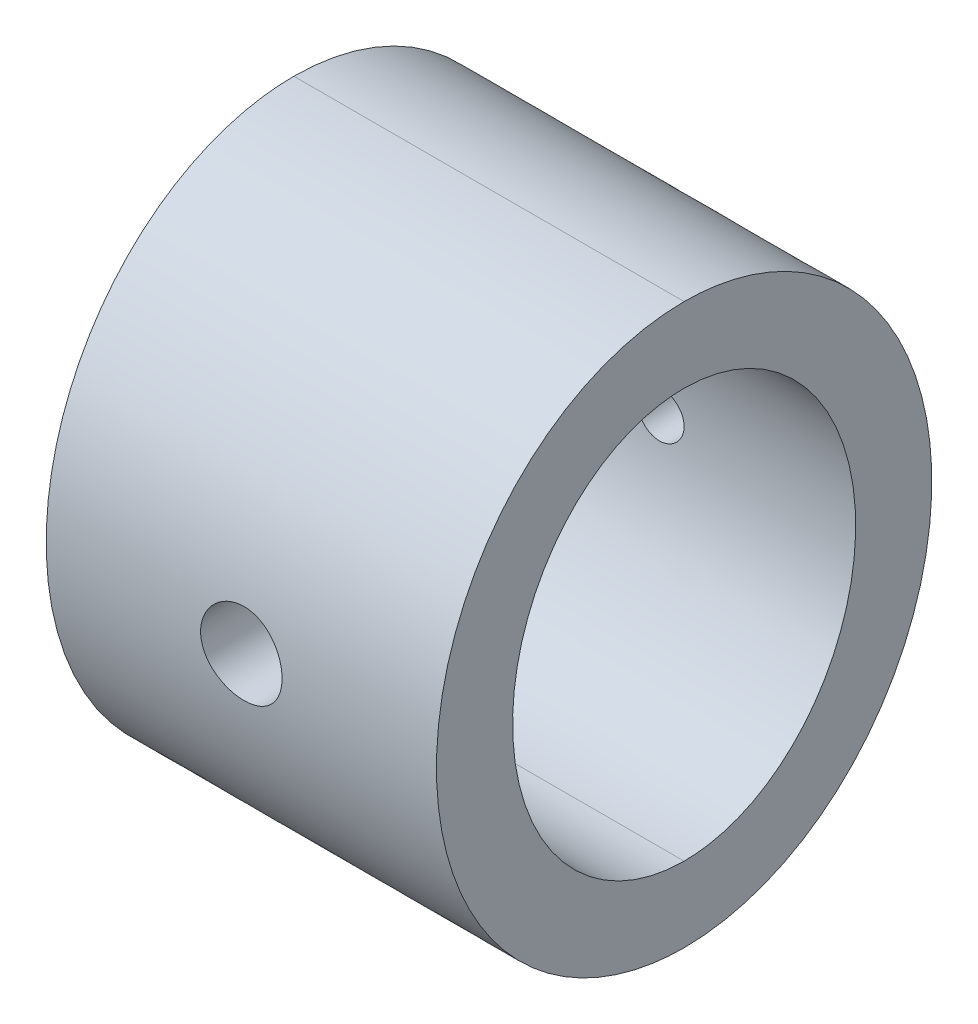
ISO-10303-21;
HEADER;
FILE_DESCRIPTION(('STEP AP214'),'2;1');
FILE_NAME('part.step','',(''),(''),'','','');
FILE_SCHEMA(('AUTOMOTIVE_DESIGN { 1 0 10303 214 1 1 1 1 }'));
ENDSEC;
DATA;
#1=APPLICATION_CONTEXT('core data for automotive mechanical design processes');
#2=APPLICATION_PROTOCOL_DEFINITION('international standard','automotive_design',2000,#1);
#3=PRODUCT_CONTEXT('',#1,'mechanical');
#4=PRODUCT('Part','Part','',(#3));
#5=PRODUCT_RELATED_PRODUCT_CATEGORY('part','',(#4));
#6=PRODUCT_DEFINITION_FORMATION('','',#4);
#7=PRODUCT_DEFINITION_CONTEXT('part definition',#1,'design');
#8=PRODUCT_DEFINITION('design','',#6,#7);
#9=PRODUCT_DEFINITION_SHAPE('','',#8);
#10=(LENGTH_UNIT() NAMED_UNIT(*) SI_UNIT(.MILLI.,.METRE.));
#11=(NAMED_UNIT(*) PLANE_ANGLE_UNIT() SI_UNIT($,.RADIAN.));
#12=(NAMED_UNIT(*) SI_UNIT($,.STERADIAN.) SOLID_ANGLE_UNIT());
#13=UNCERTAINTY_MEASURE_WITH_UNIT(LENGTH_MEASURE(1.E-05),#10,'distance_accuracy_value','');
#14=(GEOMETRIC_REPRESENTATION_CONTEXT(3) GLOBAL_UNCERTAINTY_ASSIGNED_CONTEXT((#13)) GLOBAL_UNIT_ASSIGNED_CONTEXT((#10,
#11,#12)) REPRESENTATION_CONTEXT('',''));
#15=CARTESIAN_POINT('',(0.,0.,0.));
#16=DIRECTION('',(0.,0.,1.));
#17=DIRECTION('',(1.,0.,0.));
#18=AXIS2_PLACEMENT_3D('',#15,#16,#17);
#19=CARTESIAN_POINT('',(23.114,24.257,29.337));
#20=CARTESIAN_POINT('',(-23.114,24.257,29.337));
#21=CARTESIAN_POINT('',(23.114,24.257,69.9769999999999));
#22=CARTESIAN_POINT('',(-23.114,24.257,69.9769999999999));
#23=CARTESIAN_POINT('',(23.114,-24.257,69.9769999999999));
#24=CARTESIAN_POINT('',(-23.114,-24.257,69.9769999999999));
#25=CARTESIAN_POINT('',(23.114,-24.257,29.337));
#26=CARTESIAN_POINT('',(-23.114,-24.257,29.337));
#27=(BOUNDED_SURFACE() B_SPLINE_SURFACE(3,1,((#19,#20),(#21,#22),(#23,#24),(#25,#26)),
.UNSPECIFIED.,.F.,.F.,.F.) B_SPLINE_SURFACE_WITH_KNOTS((4,4),(2,2),(0.,1.),(0.,1.),
.UNSPECIFIED.) GEOMETRIC_REPRESENTATION_ITEM() RATIONAL_B_SPLINE_SURFACE(((1.,1.),
(0.333333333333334,0.333333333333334),(0.333333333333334,0.333333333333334),(1.,1.))) REPRESENTATION_ITEM('') SURFACE());
#28=CARTESIAN_POINT('',(-23.114,-24.257,29.337));
#29=CARTESIAN_POINT('',(-23.114,-24.2570222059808,29.6689707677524));
#30=CARTESIAN_POINT('',(-23.114,-24.247289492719,30.000935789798));
#31=CARTESIAN_POINT('',(-23.114,-24.2084822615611,30.6636076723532));
#32=CARTESIAN_POINT('',(-23.114,-24.1794150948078,30.9943149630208));
#33=CARTESIAN_POINT('',(-23.114,-24.1021116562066,31.6534369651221));
#34=CARTESIAN_POINT('',(-23.114,-24.0538778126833,31.9818519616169));
#35=CARTESIAN_POINT('',(-23.114,-23.9388236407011,32.6338193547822));
#36=CARTESIAN_POINT('',(-23.114,-23.8720913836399,32.9573873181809));
#37=CARTESIAN_POINT('',(-23.114,-23.7203453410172,33.6002281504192));
#38=CARTESIAN_POINT('',(-23.114,-23.6353304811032,33.9195007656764));
#39=CARTESIAN_POINT('',(-23.114,-23.4475342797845,34.5527551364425));
#40=CARTESIAN_POINT('',(-23.114,-23.3447529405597,34.8667368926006));
#41=CARTESIAN_POINT('',(-23.114,-23.06652153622,35.6433793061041));
#42=CARTESIAN_POINT('',(-23.114,-22.8803674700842,36.1022418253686));
#43=CARTESIAN_POINT('',(-23.114,-22.4716568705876,37.0035444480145));
#44=CARTESIAN_POINT('',(-23.114,-22.2490930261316,37.4459812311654));
#45=CARTESIAN_POINT('',(-23.114,-21.8897796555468,38.0956732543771));
#46=CARTESIAN_POINT('',(-23.114,-21.7656892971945,38.3100231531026));
#47=CARTESIAN_POINT('',(-23.114,-21.5093842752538,38.7337273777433));
#48=CARTESIAN_POINT('',(-23.114,-21.3771719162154,38.9430830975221));
#49=CARTESIAN_POINT('',(-23.114,-20.9687512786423,39.5634614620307));
#50=CARTESIAN_POINT('',(-23.114,-20.6807581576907,39.9667976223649));
#51=CARTESIAN_POINT('',(-23.114,-20.0539815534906,40.7799977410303));
#52=CARTESIAN_POINT('',(-23.114,-19.713023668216,41.1881802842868));
#53=CARTESIAN_POINT('',(-23.114,-19.0012972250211,41.9776532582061));
#54=CARTESIAN_POINT('',(-23.114,-18.6305274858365,42.3589426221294));
#55=CARTESIAN_POINT('',(-23.114,-17.8622294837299,43.0936672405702));
#56=CARTESIAN_POINT('',(-23.114,-17.4646950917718,43.447096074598));
#57=CARTESIAN_POINT('',(-23.114,-16.6458871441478,44.1253195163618));
#58=CARTESIAN_POINT('',(-23.114,-16.2246108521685,44.4501108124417));
#59=CARTESIAN_POINT('',(-23.114,-15.2952397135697,45.1179067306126));
#60=CARTESIAN_POINT('',(-23.114,-14.7837051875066,45.4561299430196));
#61=CARTESIAN_POINT('',(-23.114,-13.7368299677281,46.0934467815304));
#62=CARTESIAN_POINT('',(-23.114,-13.2014872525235,46.3925370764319));
#63=CARTESIAN_POINT('',(-23.114,-12.1104616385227,46.9515014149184));
#64=CARTESIAN_POINT('',(-23.114,-11.5547706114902,47.2113595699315));
#65=CARTESIAN_POINT('',(-23.114,-10.4266388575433,47.6916833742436));
#66=CARTESIAN_POINT('',(-23.114,-9.85419736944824,47.9121472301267));
#67=CARTESIAN_POINT('',(-23.114,-8.60267869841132,48.3459745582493));
#68=CARTESIAN_POINT('',(-23.114,-7.92123106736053,48.5525208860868));
#69=CARTESIAN_POINT('',(-23.114,-6.54450006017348,48.9127969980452));
#70=CARTESIAN_POINT('',(-23.114,-5.84921507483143,49.0665206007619));
#71=CARTESIAN_POINT('',(-23.114,-4.44872044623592,49.3213605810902));
#72=CARTESIAN_POINT('',(-23.114,-3.7435065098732,49.4224534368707));
#73=CARTESIAN_POINT('',(-23.114,-2.32767864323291,49.5720641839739));
#74=CARTESIAN_POINT('',(-23.114,-1.61706451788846,49.6205801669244));
#75=CARTESIAN_POINT('',(-23.114,0.678942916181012,49.6923971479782));
#76=CARTESIAN_POINT('',(-23.114,2.26880579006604,49.6118775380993));
#77=CARTESIAN_POINT('',(-23.114,5.41494145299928,49.1891604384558));
#78=CARTESIAN_POINT('',(-23.114,6.97119063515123,48.8467848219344));
#79=CARTESIAN_POINT('',(-23.114,9.25323786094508,48.1330168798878));
#80=CARTESIAN_POINT('',(-23.114,10.0104534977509,47.8590136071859));
#81=CARTESIAN_POINT('',(-23.114,11.4971287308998,47.2430483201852));
#82=CARTESIAN_POINT('',(-23.114,12.2265851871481,46.901078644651));
#83=CARTESIAN_POINT('',(-23.114,13.6486889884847,46.1499048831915));
#84=CARTESIAN_POINT('',(-23.114,14.3413886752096,45.740799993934));
#85=CARTESIAN_POINT('',(-23.114,15.6825130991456,44.8556247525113));
#86=CARTESIAN_POINT('',(-23.114,16.3309553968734,44.3795811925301));
#87=CARTESIAN_POINT('',(-23.114,17.4008230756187,43.5038917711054));
#88=CARTESIAN_POINT('',(-23.114,17.8351543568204,43.1199254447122));
#89=CARTESIAN_POINT('',(-23.114,18.6720783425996,42.31883502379));
#90=CARTESIAN_POINT('',(-23.114,19.0746764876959,41.9017166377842));
#91=CARTESIAN_POINT('',(-23.114,19.8440293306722,41.035742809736));
#92=CARTESIAN_POINT('',(-23.114,20.2107906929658,40.5868932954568));
#93=CARTESIAN_POINT('',(-23.114,20.9044045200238,39.6591929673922));
#94=CARTESIAN_POINT('',(-23.114,21.2312566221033,39.1803418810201));
#95=CARTESIAN_POINT('',(-23.114,21.7407133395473,38.3569917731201));
#96=CARTESIAN_POINT('',(-23.114,21.9354632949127,38.0199516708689));
#97=CARTESIAN_POINT('',(-23.114,22.3037962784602,37.334433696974));
#98=CARTESIAN_POINT('',(-23.114,22.4773781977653,36.9859552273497));
#99=CARTESIAN_POINT('',(-23.114,22.8021701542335,36.2786541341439));
#100=CARTESIAN_POINT('',(-23.114,22.9533767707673,35.9198299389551));
#101=CARTESIAN_POINT('',(-23.114,23.2320282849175,35.1937930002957));
#102=CARTESIAN_POINT('',(-23.114,23.3595152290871,34.8265964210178));
#103=CARTESIAN_POINT('',(-23.114,23.5900522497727,34.0846666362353));
#104=CARTESIAN_POINT('',(-23.114,23.6931058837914,33.7099345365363));
#105=CARTESIAN_POINT('',(-23.114,23.873904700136,32.9546391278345));
#106=CARTESIAN_POINT('',(-23.114,23.9516663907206,32.5740797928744));
#107=CARTESIAN_POINT('',(-23.114,24.0564258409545,31.9555651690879));
#108=CARTESIAN_POINT('',(-23.114,24.0914519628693,31.7189415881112));
#109=CARTESIAN_POINT('',(-23.114,24.1515619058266,31.2445061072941));
#110=CARTESIAN_POINT('',(-23.114,24.1766487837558,31.0066945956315));
#111=CARTESIAN_POINT('',(-23.114,24.2368664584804,30.2925124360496));
#112=CARTESIAN_POINT('',(-23.114,24.2570477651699,29.8148424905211));
#113=CARTESIAN_POINT('',(-23.114,24.257,29.337));
#114=B_SPLINE_CURVE_WITH_KNOTS('',3,(#28,#29,#30,#31,#32,#33,#34,#35,#36,#37,#38,#39,#40,#41,
#42,#43,#44,#45,#46,#47,#48,#49,#50,#51,#52,#53,#54,#55,#56,#57,#58,#59,#60,#61,#62,#63,#64,#65,
#66,#67,#68,#69,#70,#71,#72,#73,#74,#75,#76,#77,#78,#79,#80,#81,#82,#83,#84,#85,#86,#87,#88,#89,
#90,#91,#92,#93,#94,#95,#96,#97,#98,#99,#100,#101,#102,#103,#104,#105,#106,#107,#108,#109,#110,
#111,#112,#113),.UNSPECIFIED.,.F.,.F.,(4,2,2,2,2,2,2,2,2,2,2,2,2,2,2,2,2,2,2,2,2,2,2,2,2,2,2,2,
2,2,2,2,2,2,2,2,2,2,2,2,2,2,4),(0.,0.99576051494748,1.99114264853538,2.98639871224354,
3.97699539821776,4.96765031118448,5.9583051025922,7.44213381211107,8.92626084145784,
9.66913507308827,10.4117994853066,11.8971204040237,13.4911124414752,15.0851676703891,
16.6795891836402,18.2741948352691,20.1120865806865,21.9501346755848,23.7889251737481,
25.6277993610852,27.7617733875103,29.8959970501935,32.0311737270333,34.1664279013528,
38.9192641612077,43.6753364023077,46.088355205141,48.5016461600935,50.9114029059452,
53.3201978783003,55.0577188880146,56.7949413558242,58.531840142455,60.2687547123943,
61.4358677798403,62.6030419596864,63.7703943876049,64.9356573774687,66.100750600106,
67.2650818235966,67.9824973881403,68.6996921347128,70.1324087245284),.UNSPECIFIED.);
#115=CARTESIAN_POINT('',(-23.114,-24.257,29.337));
#116=VERTEX_POINT('',#115);
#117=CARTESIAN_POINT('',(-23.114,24.257,29.337));
#118=VERTEX_POINT('',#117);
#119=EDGE_CURVE('E68',#116,#118,#114,.T.);
#120=DIRECTION('',(-1.,0.,0.));
#121=VECTOR('',#120,1.);
#122=CARTESIAN_POINT('',(0.,24.257,29.337));
#123=LINE('',#122,#121);
#124=CARTESIAN_POINT('',(23.114,24.257,29.337));
#125=VERTEX_POINT('',#124);
#126=EDGE_CURVE('E59',#125,#118,#123,.T.);
#127=CARTESIAN_POINT('',(23.114,-24.257,29.337));
#128=CARTESIAN_POINT('',(23.114,-24.2570222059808,29.6689707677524));
#129=CARTESIAN_POINT('',(23.114,-24.247289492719,30.000935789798));
#130=CARTESIAN_POINT('',(23.114,-24.2084822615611,30.6636076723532));
#131=CARTESIAN_POINT('',(23.114,-24.1794150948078,30.9943149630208));
#132=CARTESIAN_POINT('',(23.114,-24.1021116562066,31.6534369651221));
#133=CARTESIAN_POINT('',(23.114,-24.0538778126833,31.9818519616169));
#134=CARTESIAN_POINT('',(23.114,-23.9388236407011,32.6338193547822));
#135=CARTESIAN_POINT('',(23.114,-23.8720913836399,32.9573873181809));
#136=CARTESIAN_POINT('',(23.114,-23.7203453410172,33.6002281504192));
#137=CARTESIAN_POINT('',(23.114,-23.6353304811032,33.9195007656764));
#138=CARTESIAN_POINT('',(23.114,-23.4475342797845,34.5527551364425));
#139=CARTESIAN_POINT('',(23.114,-23.3447529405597,34.8667368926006));
#140=CARTESIAN_POINT('',(23.114,-23.06652153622,35.6433793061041));
#141=CARTESIAN_POINT('',(23.114,-22.8803674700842,36.1022418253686));
#142=CARTESIAN_POINT('',(23.114,-22.4716568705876,37.0035444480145));
#143=CARTESIAN_POINT('',(23.114,-22.2490930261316,37.4459812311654));
#144=CARTESIAN_POINT('',(23.114,-21.8897796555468,38.0956732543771));
#145=CARTESIAN_POINT('',(23.114,-21.7656892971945,38.3100231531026));
#146=CARTESIAN_POINT('',(23.114,-21.5093842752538,38.7337273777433));
#147=CARTESIAN_POINT('',(23.114,-21.3771719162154,38.9430830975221));
#148=CARTESIAN_POINT('',(23.114,-20.9687512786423,39.5634614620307));
#149=CARTESIAN_POINT('',(23.114,-20.6807581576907,39.9667976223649));
#150=CARTESIAN_POINT('',(23.114,-20.0539815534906,40.7799977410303));
#151=CARTESIAN_POINT('',(23.114,-19.713023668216,41.1881802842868));
#152=CARTESIAN_POINT('',(23.114,-19.0012972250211,41.9776532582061));
#153=CARTESIAN_POINT('',(23.114,-18.6305274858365,42.3589426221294));
#154=CARTESIAN_POINT('',(23.114,-17.8622294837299,43.0936672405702));
#155=CARTESIAN_POINT('',(23.114,-17.4646950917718,43.447096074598));
#156=CARTESIAN_POINT('',(23.114,-16.6458871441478,44.1253195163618));
#157=CARTESIAN_POINT('',(23.114,-16.2246108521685,44.4501108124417));
#158=CARTESIAN_POINT('',(23.114,-15.2952397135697,45.1179067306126));
#159=CARTESIAN_POINT('',(23.114,-14.7837051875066,45.4561299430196));
#160=CARTESIAN_POINT('',(23.114,-13.7368299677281,46.0934467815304));
#161=CARTESIAN_POINT('',(23.114,-13.2014872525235,46.3925370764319));
#162=CARTESIAN_POINT('',(23.114,-12.1104616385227,46.9515014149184));
#163=CARTESIAN_POINT('',(23.114,-11.5547706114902,47.2113595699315));
#164=CARTESIAN_POINT('',(23.114,-10.4266388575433,47.6916833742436));
#165=CARTESIAN_POINT('',(23.114,-9.85419736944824,47.9121472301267));
#166=CARTESIAN_POINT('',(23.114,-8.60267869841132,48.3459745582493));
#167=CARTESIAN_POINT('',(23.114,-7.92123106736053,48.5525208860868));
#168=CARTESIAN_POINT('',(23.114,-6.54450006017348,48.9127969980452));
#169=CARTESIAN_POINT('',(23.114,-5.84921507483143,49.0665206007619));
#170=CARTESIAN_POINT('',(23.114,-4.44872044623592,49.3213605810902));
#171=CARTESIAN_POINT('',(23.114,-3.7435065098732,49.4224534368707));
#172=CARTESIAN_POINT('',(23.114,-2.32767864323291,49.5720641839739));
#173=CARTESIAN_POINT('',(23.114,-1.61706451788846,49.6205801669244));
#174=CARTESIAN_POINT('',(23.114,0.678942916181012,49.6923971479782));
#175=CARTESIAN_POINT('',(23.114,2.26880579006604,49.6118775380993));
#176=CARTESIAN_POINT('',(23.114,5.41494145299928,49.1891604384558));
#177=CARTESIAN_POINT('',(23.114,6.97119063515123,48.8467848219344));
#178=CARTESIAN_POINT('',(23.114,9.25323786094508,48.1330168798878));
#179=CARTESIAN_POINT('',(23.114,10.0104534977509,47.8590136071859));
#180=CARTESIAN_POINT('',(23.114,11.4971287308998,47.2430483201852));
#181=CARTESIAN_POINT('',(23.114,12.2265851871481,46.901078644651));
#182=CARTESIAN_POINT('',(23.114,13.6486889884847,46.1499048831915));
#183=CARTESIAN_POINT('',(23.114,14.3413886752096,45.740799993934));
#184=CARTESIAN_POINT('',(23.114,15.6825130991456,44.8556247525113));
#185=CARTESIAN_POINT('',(23.114,16.3309553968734,44.3795811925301));
#186=CARTESIAN_POINT('',(23.114,17.4008230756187,43.5038917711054));
#187=CARTESIAN_POINT('',(23.114,17.8351543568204,43.1199254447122));
#188=CARTESIAN_POINT('',(23.114,18.6720783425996,42.31883502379));
#189=CARTESIAN_POINT('',(23.114,19.0746764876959,41.9017166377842));
#190=CARTESIAN_POINT('',(23.114,19.8440293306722,41.035742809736));
#191=CARTESIAN_POINT('',(23.114,20.2107906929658,40.5868932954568));
#192=CARTESIAN_POINT('',(23.114,20.9044045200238,39.6591929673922));
#193=CARTESIAN_POINT('',(23.114,21.2312566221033,39.1803418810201));
#194=CARTESIAN_POINT('',(23.114,21.7407133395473,38.3569917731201));
#195=CARTESIAN_POINT('',(23.114,21.9354632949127,38.0199516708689));
#196=CARTESIAN_POINT('',(23.114,22.3037962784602,37.334433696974));
#197=CARTESIAN_POINT('',(23.114,22.4773781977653,36.9859552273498));
#198=CARTESIAN_POINT('',(23.114,22.8021701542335,36.2786541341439));
#199=CARTESIAN_POINT('',(23.114,22.9533767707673,35.9198299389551));
#200=CARTESIAN_POINT('',(23.114,23.2320282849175,35.1937930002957));
#201=CARTESIAN_POINT('',(23.114,23.3595152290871,34.8265964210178));
#202=CARTESIAN_POINT('',(23.114,23.5900522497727,34.0846666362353));
#203=CARTESIAN_POINT('',(23.114,23.6931058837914,33.7099345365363));
#204=CARTESIAN_POINT('',(23.114,23.873904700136,32.9546391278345));
#205=CARTESIAN_POINT('',(23.114,23.9516663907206,32.5740797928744));
#206=CARTESIAN_POINT('',(23.114,24.0564258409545,31.9555651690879));
#207=CARTESIAN_POINT('',(23.114,24.0914519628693,31.7189415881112));
#208=CARTESIAN_POINT('',(23.114,24.1515619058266,31.2445061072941));
#209=CARTESIAN_POINT('',(23.114,24.1766487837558,31.0066945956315));
#210=CARTESIAN_POINT('',(23.114,24.2368664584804,30.2925124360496));
#211=CARTESIAN_POINT('',(23.114,24.2570477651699,29.8148424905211));
#212=CARTESIAN_POINT('',(23.114,24.257,29.337));
#213=B_SPLINE_CURVE_WITH_KNOTS('',3,(#127,#128,#129,#130,#131,#132,#133,#134,#135,#136,#137,
#138,#139,#140,#141,#142,#143,#144,#145,#146,#147,#148,#149,#150,#151,#152,#153,#154,#155,#156,
#157,#158,#159,#160,#161,#162,#163,#164,#165,#166,#167,#168,#169,#170,#171,#172,#173,#174,#175,
#176,#177,#178,#179,#180,#181,#182,#183,#184,#185,#186,#187,#188,#189,#190,#191,#192,#193,#194,
#195,#196,#197,#198,#199,#200,#201,#202,#203,#204,#205,#206,#207,#208,#209,#210,#211,#212),
.UNSPECIFIED.,.F.,.F.,(4,2,2,2,2,2,2,2,2,2,2,2,2,2,2,2,2,2,2,2,2,2,2,2,2,2,2,2,2,2,2,2,2,2,2,2,
2,2,2,2,2,2,4),(0.,0.99576051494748,1.99114264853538,2.98639871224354,3.97699539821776,
4.96765031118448,5.9583051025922,7.44213381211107,8.92626084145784,9.66913507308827,
10.4117994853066,11.8971204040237,13.4911124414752,15.0851676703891,16.6795891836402,
18.2741948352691,20.1120865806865,21.9501346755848,23.7889251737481,25.6277993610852,
27.7617733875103,29.8959970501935,32.0311737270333,34.1664279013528,38.9192641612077,
43.6753364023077,46.088355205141,48.5016461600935,50.9114029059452,53.3201978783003,
55.0577188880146,56.7949413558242,58.531840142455,60.2687547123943,61.4358677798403,
62.6030419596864,63.7703943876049,64.9356573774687,66.100750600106,67.2650818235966,
67.9824973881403,68.6996921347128,70.1324087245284),.UNSPECIFIED.);
#214=CARTESIAN_POINT('',(23.114,-24.257,29.337));
#215=VERTEX_POINT('',#214);
#216=EDGE_CURVE('E69',#215,#125,#213,.T.);
#217=DIRECTION('',(1.,0.,0.));
#218=VECTOR('',#217,1.);
#219=CARTESIAN_POINT('',(0.,-24.257,29.337));
#220=LINE('',#219,#218);
#221=EDGE_CURVE('E65',#116,#215,#220,.T.);
#222=CARTESIAN_POINT('',(2.73218947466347E-11,-4.826,49.2507840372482));
#223=CARTESIAN_POINT('',(0.134442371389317,-4.82599932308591,49.2507843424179));
#224=CARTESIAN_POINT('',(0.268903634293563,-4.82037731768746,49.2517420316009));
#225=CARTESIAN_POINT('',(0.536912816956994,-4.79792626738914,49.2555461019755));
#226=CARTESIAN_POINT('',(0.670460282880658,-4.78109201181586,49.2583933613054));
#227=CARTESIAN_POINT('',(0.935849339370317,-4.73630644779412,49.2658991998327));
#228=CARTESIAN_POINT('',(1.06768784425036,-4.70833732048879,49.2705606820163));
#229=CARTESIAN_POINT('',(1.32854806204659,-4.64148393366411,49.2815599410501));
#230=CARTESIAN_POINT('',(1.4575686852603,-4.60259552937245,49.2878983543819));
#231=CARTESIAN_POINT('',(1.71162416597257,-4.51427458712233,49.3020540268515));
#232=CARTESIAN_POINT('',(1.83666526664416,-4.46485960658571,49.3098688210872));
#233=CARTESIAN_POINT('',(2.08216503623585,-4.35579076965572,49.3267623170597));
#234=CARTESIAN_POINT('',(2.20262199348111,-4.29613313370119,49.3358414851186));
#235=CARTESIAN_POINT('',(2.43799253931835,-4.16706961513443,49.3549956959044));
#236=CARTESIAN_POINT('',(2.55291022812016,-4.09767109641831,49.3650699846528));
#237=CARTESIAN_POINT('',(2.77656401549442,-3.9495525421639,49.3859405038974));
#238=CARTESIAN_POINT('',(2.885297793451,-3.8708290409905,49.3967370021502));
#239=CARTESIAN_POINT('',(3.09672028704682,-3.70390296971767,49.4188430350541));
#240=CARTESIAN_POINT('',(3.19934839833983,-3.61562411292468,49.4301562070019));
#241=CARTESIAN_POINT('',(3.39685939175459,-3.43073287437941,49.4528930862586));
#242=CARTESIAN_POINT('',(3.49173939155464,-3.33411741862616,49.4643168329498));
#243=CARTESIAN_POINT('',(3.67303630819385,-3.13326947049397,49.4869479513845));
#244=CARTESIAN_POINT('',(3.75945538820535,-3.02903893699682,49.4981553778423));
#245=CARTESIAN_POINT('',(3.92328727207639,-2.81361193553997,49.5200482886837));
#246=CARTESIAN_POINT('',(4.00069674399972,-2.70241291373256,49.5307335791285));
#247=CARTESIAN_POINT('',(4.14633148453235,-2.47320643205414,49.5513373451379));
#248=CARTESIAN_POINT('',(4.2145029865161,-2.35516438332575,49.5612511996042));
#249=CARTESIAN_POINT('',(4.34067387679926,-2.11362212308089,49.5799690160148));
#250=CARTESIAN_POINT('',(4.39866946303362,-1.9901198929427,49.5887725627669));
#251=CARTESIAN_POINT('',(4.50400191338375,-1.73862605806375,49.6050126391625));
#252=CARTESIAN_POINT('',(4.55134337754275,-1.61063641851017,49.6124497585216));
#253=CARTESIAN_POINT('',(4.63505443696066,-1.35098462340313,49.6257529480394));
#254=CARTESIAN_POINT('',(4.67141996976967,-1.21932112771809,49.6316184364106));
#255=CARTESIAN_POINT('',(4.73257457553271,-0.954613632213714,49.6415589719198));
#256=CARTESIAN_POINT('',(4.75747251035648,-0.821595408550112,49.6456508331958));
#257=CARTESIAN_POINT('',(4.79602414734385,-0.553833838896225,49.6520128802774));
#258=CARTESIAN_POINT('',(4.80967275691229,-0.419089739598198,49.654282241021));
#259=CARTESIAN_POINT('',(4.82559932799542,-0.148920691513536,49.6569321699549));
#260=CARTESIAN_POINT('',(4.8278779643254,-0.0134957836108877,49.6573128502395));
#261=CARTESIAN_POINT('',(4.82105002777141,0.256996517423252,49.6561752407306));
#262=CARTESIAN_POINT('',(4.8119486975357,0.392064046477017,49.6546578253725));
#263=CARTESIAN_POINT('',(4.78258151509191,0.659646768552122,49.6497915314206));
#264=CARTESIAN_POINT('',(4.76242246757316,0.792174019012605,49.6464601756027));
#265=CARTESIAN_POINT('',(4.71117688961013,1.05499116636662,49.638071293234));
#266=CARTESIAN_POINT('',(4.68009444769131,1.18528188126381,49.6330144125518));
#267=CARTESIAN_POINT('',(4.6072202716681,1.44281425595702,49.6213107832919));
#268=CARTESIAN_POINT('',(4.56542434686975,1.57005470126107,49.6146634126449));
#269=CARTESIAN_POINT('',(4.47145517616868,1.82050756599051,49.5999645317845));
#270=CARTESIAN_POINT('',(4.41928560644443,1.94372139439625,49.5919135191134));
#271=CARTESIAN_POINT('',(4.30465477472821,2.18592370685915,49.5745824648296));
#272=CARTESIAN_POINT('',(4.24214391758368,2.30488829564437,49.5652965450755));
#273=CARTESIAN_POINT('',(4.1074857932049,2.53709349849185,49.5457850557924));
#274=CARTESIAN_POINT('',(4.03534195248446,2.65033612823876,49.5355598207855));
#275=CARTESIAN_POINT('',(3.88187915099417,2.87041690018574,49.5144431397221));
#276=CARTESIAN_POINT('',(3.80055697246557,2.97725277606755,49.503551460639));
#277=CARTESIAN_POINT('',(3.62934902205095,3.18372124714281,49.4814075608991));
#278=CARTESIAN_POINT('',(3.53946630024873,3.28335638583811,49.4701554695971));
#279=CARTESIAN_POINT('',(3.35056225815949,3.4759788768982,49.447456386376));
#280=CARTESIAN_POINT('',(3.2514418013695,3.56886895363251,49.4360087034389));
#281=CARTESIAN_POINT('',(3.04574555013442,3.74594720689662,49.4133840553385));
#282=CARTESIAN_POINT('',(2.93917247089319,3.83013852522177,49.4022069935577));
#283=CARTESIAN_POINT('',(2.71918024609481,3.98933387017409,49.3804280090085));
#284=CARTESIAN_POINT('',(2.60575550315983,4.06433022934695,49.3698265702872));
#285=CARTESIAN_POINT('',(2.3729680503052,4.20449168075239,49.3495173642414));
#286=CARTESIAN_POINT('',(2.25360760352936,4.2696604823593,49.3398092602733));
#287=CARTESIAN_POINT('',(2.0094486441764,4.38986927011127,49.3215420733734));
#288=CARTESIAN_POINT('',(1.88463781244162,4.44488466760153,49.312985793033));
#289=CARTESIAN_POINT('',(1.63077722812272,4.54416206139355,49.2973049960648));
#290=CARTESIAN_POINT('',(1.50172913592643,4.58842821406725,49.2901799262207));
#291=CARTESIAN_POINT('',(1.24049715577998,4.66583021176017,49.2775801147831));
#292=CARTESIAN_POINT('',(1.10831890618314,4.69898464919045,49.2721026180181));
#293=CARTESIAN_POINT('',(0.841625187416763,4.75399488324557,49.2629482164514));
#294=CARTESIAN_POINT('',(0.707110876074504,4.77585612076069,49.2592704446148));
#295=CARTESIAN_POINT('',(0.477050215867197,4.80331462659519,49.2546347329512));
#296=CARTESIAN_POINT('',(0.381850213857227,4.81181824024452,49.2531927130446));
#297=CARTESIAN_POINT('',(0.191103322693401,4.82316117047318,49.2512672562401));
#298=CARTESIAN_POINT('',(0.0955564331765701,4.82600048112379,49.2507838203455));
#299=CARTESIAN_POINT('',(-0.13444237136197,4.82599932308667,49.2507843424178));
#300=CARTESIAN_POINT('',(-0.268903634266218,4.82037731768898,49.2517420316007));
#301=CARTESIAN_POINT('',(-0.536912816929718,4.79792626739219,49.2555461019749));
#302=CARTESIAN_POINT('',(-0.670460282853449,4.78109201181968,49.2583933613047));
#303=CARTESIAN_POINT('',(-0.935849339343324,4.73630644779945,49.2658991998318));
#304=CARTESIAN_POINT('',(-1.06768784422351,4.70833732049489,49.2705606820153));
#305=CARTESIAN_POINT('',(-1.32854806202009,4.64148393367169,49.2815599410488));
#306=CARTESIAN_POINT('',(-1.45756868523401,4.60259552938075,49.2878983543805));
#307=CARTESIAN_POINT('',(-1.71162416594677,4.51427458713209,49.3020540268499));
#308=CARTESIAN_POINT('',(-1.83666526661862,4.46485960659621,49.3098688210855));
#309=CARTESIAN_POINT('',(-2.08216503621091,4.35579076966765,49.3267623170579));
#310=CARTESIAN_POINT('',(-2.20262199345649,4.29613313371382,49.3358414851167));
#311=CARTESIAN_POINT('',(-2.43799253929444,4.16706961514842,49.3549956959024));
#312=CARTESIAN_POINT('',(-2.55291022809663,4.09767109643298,49.3650699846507));
#313=CARTESIAN_POINT('',(-2.77656401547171,3.94955254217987,49.3859405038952));
#314=CARTESIAN_POINT('',(-2.88529779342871,3.87082904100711,49.396737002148));
#315=CARTESIAN_POINT('',(-3.09672028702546,3.70390296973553,49.4188430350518));
#316=CARTESIAN_POINT('',(-3.19934839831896,3.61562411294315,49.4301562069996));
#317=CARTESIAN_POINT('',(-3.39685939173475,3.43073287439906,49.4528930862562));
#318=CARTESIAN_POINT('',(-3.49173939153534,3.33411741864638,49.4643168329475));
#319=CARTESIAN_POINT('',(-3.67303630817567,3.13326947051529,49.4869479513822));
#320=CARTESIAN_POINT('',(-3.75945538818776,3.02903893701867,49.49815537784));
#321=CARTESIAN_POINT('',(-3.92328727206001,2.81361193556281,49.5200482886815));
#322=CARTESIAN_POINT('',(-4.00069674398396,2.70241291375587,49.5307335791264));
#323=CARTESIAN_POINT('',(-4.14633148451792,2.47320643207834,49.5513373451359));
#324=CARTESIAN_POINT('',(-4.21450298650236,2.35516438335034,49.5612511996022));
#325=CARTESIAN_POINT('',(-4.34067387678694,2.11362212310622,49.579969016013));
#326=CARTESIAN_POINT('',(-4.39866946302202,1.99011989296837,49.5887725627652));
#327=CARTESIAN_POINT('',(-4.50400191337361,1.73862605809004,49.605012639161));
#328=CARTESIAN_POINT('',(-4.55134337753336,1.61063641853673,49.6124497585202));
#329=CARTESIAN_POINT('',(-4.6350544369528,1.35098462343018,49.6257529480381));
#330=CARTESIAN_POINT('',(-4.67141996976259,1.21932112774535,49.6316184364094));
#331=CARTESIAN_POINT('',(-4.73257457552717,0.954613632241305,49.6415589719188));
#332=CARTESIAN_POINT('',(-4.7574725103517,0.821595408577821,49.645650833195));
#333=CARTESIAN_POINT('',(-4.79602414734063,0.553833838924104,49.6520128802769));
#334=CARTESIAN_POINT('',(-4.80967275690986,0.419089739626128,49.6542822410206));
#335=CARTESIAN_POINT('',(-4.82559932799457,0.148920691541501,49.6569321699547));
#336=CARTESIAN_POINT('',(-4.82787796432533,0.0134957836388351,49.6573128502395));
#337=CARTESIAN_POINT('',(-4.82105002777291,-0.256996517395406,49.6561752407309));
#338=CARTESIAN_POINT('',(-4.81194869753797,-0.392064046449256,49.654657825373));
#339=CARTESIAN_POINT('',(-4.78258151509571,-0.659646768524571,49.6497915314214));
#340=CARTESIAN_POINT('',(-4.76242246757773,-0.792174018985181,49.6464601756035));
#341=CARTESIAN_POINT('',(-4.71117688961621,-1.05499116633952,49.638071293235));
#342=CARTESIAN_POINT('',(-4.68009444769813,-1.1852818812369,49.6330144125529));
#343=CARTESIAN_POINT('',(-4.6072202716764,-1.44281425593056,49.6213107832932));
#344=CARTESIAN_POINT('',(-4.56542434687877,-1.57005470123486,49.6146634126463));
#345=CARTESIAN_POINT('',(-4.47145517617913,-1.82050756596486,49.5999645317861));
#346=CARTESIAN_POINT('',(-4.41928560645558,-1.94372139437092,49.5919135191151));
#347=CARTESIAN_POINT('',(-4.30465477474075,-2.18592370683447,49.5745824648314));
#348=CARTESIAN_POINT('',(-4.24214391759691,-2.30488829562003,49.5652965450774));
#349=CARTESIAN_POINT('',(-4.10748579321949,-2.53709349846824,49.5457850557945));
#350=CARTESIAN_POINT('',(-4.03534195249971,-2.65033612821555,49.5355598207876));
#351=CARTESIAN_POINT('',(-3.88187915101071,-2.87041690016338,49.5144431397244));
#352=CARTESIAN_POINT('',(-3.80055697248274,-2.97725277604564,49.5035514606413));
#353=CARTESIAN_POINT('',(-3.62934902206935,-3.18372124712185,49.4814075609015));
#354=CARTESIAN_POINT('',(-3.53946630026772,-3.28335638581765,49.4701554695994));
#355=CARTESIAN_POINT('',(-3.35056225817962,-3.4759788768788,49.4474563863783));
#356=CARTESIAN_POINT('',(-3.25144180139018,-3.56886895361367,49.4360087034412));
#357=CARTESIAN_POINT('',(-3.04574555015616,-3.74594720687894,49.4133840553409));
#358=CARTESIAN_POINT('',(-2.93917247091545,-3.8301385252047,49.40220699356));
#359=CARTESIAN_POINT('',(-2.71918024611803,-3.98933387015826,49.3804280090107));
#360=CARTESIAN_POINT('',(-2.60575550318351,-4.06433022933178,49.3698265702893));
#361=CARTESIAN_POINT('',(-2.37296805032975,-4.20449168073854,49.3495173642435));
#362=CARTESIAN_POINT('',(-2.25360760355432,-4.26966048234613,49.3398092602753));
#363=CARTESIAN_POINT('',(-2.00944864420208,-4.38986927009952,49.3215420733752));
#364=CARTESIAN_POINT('',(-1.88463781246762,-4.44488466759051,49.3129857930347));
#365=CARTESIAN_POINT('',(-1.63077722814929,-4.54416206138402,49.2973049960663));
#366=CARTESIAN_POINT('',(-1.50172913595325,-4.58842821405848,49.2901799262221));
#367=CARTESIAN_POINT('',(-1.24049715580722,-4.66583021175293,49.2775801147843));
#368=CARTESIAN_POINT('',(-1.10831890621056,-4.69898464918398,49.2721026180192));
#369=CARTESIAN_POINT('',(-0.841625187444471,-4.75399488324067,49.2629482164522));
#370=CARTESIAN_POINT('',(-0.707110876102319,-4.77585612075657,49.2592704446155));
#371=CARTESIAN_POINT('',(-0.477050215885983,-4.80331462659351,49.2546347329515));
#372=CARTESIAN_POINT('',(-0.38185021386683,-4.81181824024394,49.2531927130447));
#373=CARTESIAN_POINT('',(-0.191103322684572,-4.82316117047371,49.25126725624));
#374=CARTESIAN_POINT('',(-0.0955564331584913,-4.82600048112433,49.2507838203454));
#375=CARTESIAN_POINT('',(2.73218947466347E-11,-4.826,49.2507840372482));
#376=B_SPLINE_CURVE_WITH_KNOTS('',3,(#222,#223,#224,#225,#226,#227,#228,#229,#230,#231,#232,
#233,#234,#235,#236,#237,#238,#239,#240,#241,#242,#243,#244,#245,#246,#247,#248,#249,#250,#251,
#252,#253,#254,#255,#256,#257,#258,#259,#260,#261,#262,#263,#264,#265,#266,#267,#268,#269,#270,
#271,#272,#273,#274,#275,#276,#277,#278,#279,#280,#281,#282,#283,#284,#285,#286,#287,#288,#289,
#290,#291,#292,#293,#294,#295,#296,#297,#298,#299,#300,#301,#302,#303,#304,#305,#306,#307,#308,
#309,#310,#311,#312,#313,#314,#315,#316,#317,#318,#319,#320,#321,#322,#323,#324,#325,#326,#327,
#328,#329,#330,#331,#332,#333,#334,#335,#336,#337,#338,#339,#340,#341,#342,#343,#344,#345,#346,
#347,#348,#349,#350,#351,#352,#353,#354,#355,#356,#357,#358,#359,#360,#361,#362,#363,#364,#365,
#366,#367,#368,#369,#370,#371,#372,#373,#374,#375),.UNSPECIFIED.,.T.,.F.,(4,2,2,2,2,2,2,2,2,2,2,
2,2,2,2,2,2,2,2,2,2,2,2,2,2,2,2,2,2,2,2,2,2,2,2,2,2,2,2,2,2,2,2,2,2,2,2,2,2,2,2,2,2,2,2,2,2,2,2,
2,2,2,2,2,2,2,2,2,2,2,2,2,2,2,2,2,4),(0.,0.403239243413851,0.806666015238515,1.21074099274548,
1.61496955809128,2.01852911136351,2.42223790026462,2.82564312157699,3.22919874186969,
3.63625422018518,4.04346044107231,4.45056227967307,4.85781419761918,5.2673429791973,
5.67702445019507,6.08652869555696,6.49618432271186,6.90186659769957,7.3077324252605,
7.71357416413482,8.11922900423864,8.52103297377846,8.92268671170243,9.32449780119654,
9.72616675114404,10.1298210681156,10.5333321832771,10.9369852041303,11.3404949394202,
11.7489870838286,12.1573311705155,12.5660134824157,12.9745411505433,13.3840455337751,
13.7933913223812,14.2020487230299,14.6105090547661,14.8971155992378,15.1837224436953,
15.5869616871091,15.9903884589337,16.3944634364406,16.7986920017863,17.2022515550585,
17.6059603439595,18.0093655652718,18.4129211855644,18.8199766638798,19.2271828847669,
19.6342847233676,20.0415366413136,20.4510654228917,20.8607468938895,21.2702511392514,
21.6799067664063,22.0855890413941,22.4914548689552,22.8972966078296,23.3029514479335,
23.7047554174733,24.1064091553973,24.5082202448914,24.909889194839,25.3135435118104,
25.7170546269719,26.120707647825,26.5242173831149,26.9327095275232,27.34105361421,
27.7497359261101,28.1582635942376,28.5677679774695,28.9771137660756,29.3857711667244,
29.7942314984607,30.08083804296,30.3674448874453),.UNSPECIFIED.);
#377=CARTESIAN_POINT('',(2.73218947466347E-11,-4.826,49.2507840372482));
#378=VERTEX_POINT('',#377);
#379=EDGE_CURVE('E20',#378,#378,#376,.T.);
#380=ORIENTED_EDGE('',*,*,#119,.T.);
#381=ORIENTED_EDGE('',*,*,#126,.F.);
#382=ORIENTED_EDGE('',*,*,#216,.F.);
#383=ORIENTED_EDGE('',*,*,#221,.F.);
#384=EDGE_LOOP('',(#380,#381,#382,#383));
#385=FACE_BOUND('',#384,.T.);
#386=ORIENTED_EDGE('',*,*,#379,.T.);
#387=EDGE_LOOP('',(#386));
#388=FACE_BOUND('',#387,.T.);
#389=ADVANCED_FACE('F14',(#385,#388),#27,.T.);
#390=CARTESIAN_POINT('',(0.,0.,58.674));
#391=DIRECTION('',(0.,0.,-1.));
#392=DIRECTION('',(0.,1.,0.));
#393=AXIS2_PLACEMENT_3D('',#390,#391,#392);
#394=CYLINDRICAL_SURFACE('',#393,4.826);
#395=CARTESIAN_POINT('',(1.41900380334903E-12,-4.826,58.3613978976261));
#396=CARTESIAN_POINT('',(0.134866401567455,-4.8259992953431,58.3613981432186));
#397=CARTESIAN_POINT('',(0.269753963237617,-4.82034181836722,58.3621362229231));
#398=CARTESIAN_POINT('',(0.538617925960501,-4.79774733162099,58.365068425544));
#399=CARTESIAN_POINT('',(0.672593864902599,-4.780804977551,58.3672632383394));
#400=CARTESIAN_POINT('',(0.938848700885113,-4.73572574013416,58.3730505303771));
#401=CARTESIAN_POINT('',(1.07112443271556,-4.70757043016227,58.3766453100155));
#402=CARTESIAN_POINT('',(1.33285725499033,-4.64026226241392,58.3851299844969));
#403=CARTESIAN_POINT('',(1.46231325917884,-4.60110524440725,58.3900203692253));
#404=CARTESIAN_POINT('',(1.71725243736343,-4.51215246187,58.4009465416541));
#405=CARTESIAN_POINT('',(1.84274117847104,-4.46237244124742,58.4069806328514));
#406=CARTESIAN_POINT('',(2.08911231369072,-4.35248048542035,58.4200288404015));
#407=CARTESIAN_POINT('',(2.20999298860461,-4.29236473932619,58.4270433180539));
#408=CARTESIAN_POINT('',(2.44616571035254,-4.16229611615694,58.4418453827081));
#409=CARTESIAN_POINT('',(2.56146208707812,-4.09235103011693,58.4496323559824));
#410=CARTESIAN_POINT('',(2.78581440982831,-3.94305425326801,58.4657673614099));
#411=CARTESIAN_POINT('',(2.89486802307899,-3.86369907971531,58.4741156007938));
#412=CARTESIAN_POINT('',(3.10647338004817,-3.6957325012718,58.491179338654));
#413=CARTESIAN_POINT('',(3.2089894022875,-3.60707625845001,58.4998964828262));
#414=CARTESIAN_POINT('',(3.40623739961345,-3.4214284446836,58.5174153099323));
#415=CARTESIAN_POINT('',(3.50096649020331,-3.32443381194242,58.5262170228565));
#416=CARTESIAN_POINT('',(3.68191496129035,-3.12283832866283,58.5436517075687));
#417=CARTESIAN_POINT('',(3.76813651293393,-3.01823943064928,58.5522847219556));
#418=CARTESIAN_POINT('',(3.93152079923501,-2.80210259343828,58.5691446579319));
#419=CARTESIAN_POINT('',(4.00868037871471,-2.69056225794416,58.5773714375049));
#420=CARTESIAN_POINT('',(4.15360069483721,-2.46096876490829,58.5932108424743));
#421=CARTESIAN_POINT('',(4.22132920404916,-2.34289511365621,58.6008213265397));
#422=CARTESIAN_POINT('',(4.3465916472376,-2.10140868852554,58.6151818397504));
#423=CARTESIAN_POINT('',(4.40412562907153,-1.97799593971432,58.6219318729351));
#424=CARTESIAN_POINT('',(4.50858578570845,-1.72668747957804,58.6343808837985));
#425=CARTESIAN_POINT('',(4.55551046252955,-1.59879113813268,58.6400797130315));
#426=CARTESIAN_POINT('',(4.63837864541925,-1.33949187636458,58.6502611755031));
#427=CARTESIAN_POINT('',(4.67432609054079,-1.20809023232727,58.6547442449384));
#428=CARTESIAN_POINT('',(4.73483478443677,-0.943373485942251,58.6623492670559));
#429=CARTESIAN_POINT('',(4.75945438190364,-0.810071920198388,58.6654781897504));
#430=CARTESIAN_POINT('',(4.79739073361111,-0.541895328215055,58.6703194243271));
#431=CARTESIAN_POINT('',(4.81071173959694,-0.407020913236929,58.6720322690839));
#432=CARTESIAN_POINT('',(4.82596866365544,-0.136573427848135,58.6739951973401));
#433=CARTESIAN_POINT('',(4.8279007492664,-0.00100013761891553,58.6742447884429));
#434=CARTESIAN_POINT('',(4.82035636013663,0.269772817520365,58.6732729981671));
#435=CARTESIAN_POINT('',(4.81088414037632,0.404972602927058,58.6720521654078));
#436=CARTESIAN_POINT('',(4.78069428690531,0.67332598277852,58.6681858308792));
#437=CARTESIAN_POINT('',(4.76003961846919,0.806486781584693,58.6655483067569));
#438=CARTESIAN_POINT('',(4.70768947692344,1.07053473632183,58.6589286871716));
#439=CARTESIAN_POINT('',(4.67599807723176,1.20142271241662,58.6549470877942));
#440=CARTESIAN_POINT('',(4.60179167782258,1.46010340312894,58.6457482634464));
#441=CARTESIAN_POINT('',(4.55927250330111,1.58789490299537,58.6405305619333));
#442=CARTESIAN_POINT('',(4.4637435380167,1.83939054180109,58.6290076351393));
#443=CARTESIAN_POINT('',(4.41073751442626,1.96309612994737,58.6227028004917));
#444=CARTESIAN_POINT('',(4.2944207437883,2.2059953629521,58.6091576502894));
#445=CARTESIAN_POINT('',(4.23107781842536,2.32517343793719,58.601914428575));
#446=CARTESIAN_POINT('',(4.09467768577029,2.55774569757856,58.5867119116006));
#447=CARTESIAN_POINT('',(4.02162273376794,2.67114121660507,58.5787527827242));
#448=CARTESIAN_POINT('',(3.8663239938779,2.89135826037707,58.5623409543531));
#449=CARTESIAN_POINT('',(3.78408395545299,2.99818244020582,58.5538884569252));
#450=CARTESIAN_POINT('',(3.61091413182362,3.20464815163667,58.5367161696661));
#451=CARTESIAN_POINT('',(3.51997596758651,3.30428259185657,58.5279961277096));
#452=CARTESIAN_POINT('',(3.23384238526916,3.59249529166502,58.5016916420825));
#453=CARTESIAN_POINT('',(3.02626728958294,3.76905190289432,58.4840664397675));
#454=CARTESIAN_POINT('',(2.58428278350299,4.08478995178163,58.4507305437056));
#455=CARTESIAN_POINT('',(2.34987488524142,4.22397349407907,58.4350197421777));
#456=CARTESIAN_POINT('',(1.98310392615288,4.40183671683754,58.414215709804));
#457=CARTESIAN_POINT('',(1.8581313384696,4.4560275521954,58.4077341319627));
#458=CARTESIAN_POINT('',(1.60407919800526,4.5536451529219,58.3958827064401));
#459=CARTESIAN_POINT('',(1.47500305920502,4.59708061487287,58.3905119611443));
#460=CARTESIAN_POINT('',(1.21381605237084,4.67283609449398,58.3810434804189));
#461=CARTESIAN_POINT('',(1.08171028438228,4.70517351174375,58.3769437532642));
#462=CARTESIAN_POINT('',(0.815231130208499,4.75858458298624,58.3701257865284));
#463=CARTESIAN_POINT('',(0.680858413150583,4.7796615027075,58.3674071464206));
#464=CARTESIAN_POINT('',(0.455262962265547,4.8053437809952,58.3640837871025));
#465=CARTESIAN_POINT('',(0.364391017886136,4.81308703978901,58.3630778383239));
#466=CARTESIAN_POINT('',(0.182349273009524,4.82341538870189,58.3617348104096));
#467=CARTESIAN_POINT('',(0.0911794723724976,4.82600047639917,58.3613977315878));
#468=CARTESIAN_POINT('',(-0.134866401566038,4.82599929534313,58.3613981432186));
#469=CARTESIAN_POINT('',(-0.269753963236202,4.8203418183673,58.362136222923));
#470=CARTESIAN_POINT('',(-0.53861792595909,4.79774733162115,58.365068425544));
#471=CARTESIAN_POINT('',(-0.672593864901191,4.78080497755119,58.3672632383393));
#472=CARTESIAN_POINT('',(-0.938848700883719,4.73572574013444,58.373050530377));
#473=CARTESIAN_POINT('',(-1.07112443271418,4.70757043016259,58.3766453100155));
#474=CARTESIAN_POINT('',(-1.33285725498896,4.64026226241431,58.3851299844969));
#475=CARTESIAN_POINT('',(-1.46231325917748,4.60110524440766,58.3900203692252));
#476=CARTESIAN_POINT('',(-1.7172524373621,4.51215246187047,58.400946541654));
#477=CARTESIAN_POINT('',(-1.84274117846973,4.46237244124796,58.4069806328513));
#478=CARTESIAN_POINT('',(-2.08911231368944,4.35248048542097,58.4200288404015));
#479=CARTESIAN_POINT('',(-2.20999298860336,4.29236473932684,58.4270433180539));
#480=CARTESIAN_POINT('',(-2.44616571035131,4.16229611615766,58.441845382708));
#481=CARTESIAN_POINT('',(-2.56146208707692,4.09235103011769,58.4496323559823));
#482=CARTESIAN_POINT('',(-2.78581440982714,3.94305425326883,58.4657673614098));
#483=CARTESIAN_POINT('',(-2.89486802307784,3.86369907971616,58.4741156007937));
#484=CARTESIAN_POINT('',(-3.10647338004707,3.69573250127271,58.4911793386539));
#485=CARTESIAN_POINT('',(-3.20898940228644,3.60707625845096,58.4998964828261));
#486=CARTESIAN_POINT('',(-3.40623739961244,3.42142844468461,58.5174153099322));
#487=CARTESIAN_POINT('',(-3.50096649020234,3.32443381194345,58.5262170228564));
#488=CARTESIAN_POINT('',(-3.68191496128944,3.12283832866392,58.5436517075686));
#489=CARTESIAN_POINT('',(-3.76813651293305,3.0182394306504,58.5522847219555));
#490=CARTESIAN_POINT('',(-3.93152079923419,2.80210259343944,58.5691446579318));
#491=CARTESIAN_POINT('',(-4.00868037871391,2.69056225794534,58.5773714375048));
#492=CARTESIAN_POINT('',(-4.15360069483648,2.46096876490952,58.5932108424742));
#493=CARTESIAN_POINT('',(-4.22132920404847,2.34289511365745,58.6008213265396));
#494=CARTESIAN_POINT('',(-4.34659164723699,2.10140868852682,58.6151818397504));
#495=CARTESIAN_POINT('',(-4.40412562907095,1.97799593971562,58.6219318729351));
#496=CARTESIAN_POINT('',(-4.50858578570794,1.72668747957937,58.6343808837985));
#497=CARTESIAN_POINT('',(-4.55551046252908,1.59879113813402,58.6400797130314));
#498=CARTESIAN_POINT('',(-4.63837864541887,1.33949187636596,58.6502611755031));
#499=CARTESIAN_POINT('',(-4.67432609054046,1.20809023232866,58.6547442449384));
#500=CARTESIAN_POINT('',(-4.73483478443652,0.943373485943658,58.6623492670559));
#501=CARTESIAN_POINT('',(-4.75945438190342,0.810071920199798,58.6654781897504));
#502=CARTESIAN_POINT('',(-4.79739073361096,0.54189532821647,58.6703194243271));
#503=CARTESIAN_POINT('',(-4.81071173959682,0.407020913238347,58.6720322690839));
#504=CARTESIAN_POINT('',(-4.82596866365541,0.136573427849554,58.6739951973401));
#505=CARTESIAN_POINT('',(-4.82790074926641,0.00100013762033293,58.6742447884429));
#506=CARTESIAN_POINT('',(-4.82035636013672,-0.269772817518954,58.6732729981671));
#507=CARTESIAN_POINT('',(-4.81088414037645,-0.404972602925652,58.6720521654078));
#508=CARTESIAN_POINT('',(-4.78069428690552,-0.673325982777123,58.6681858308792));
#509=CARTESIAN_POINT('',(-4.76003961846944,-0.8064867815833,58.6655483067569));
#510=CARTESIAN_POINT('',(-4.70768947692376,-1.07053473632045,58.6589286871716));
#511=CARTESIAN_POINT('',(-4.67599807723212,-1.20142271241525,58.6549470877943));
#512=CARTESIAN_POINT('',(-4.60179167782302,-1.46010340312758,58.6457482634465));
#513=CARTESIAN_POINT('',(-4.55927250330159,-1.58789490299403,58.6405305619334));
#514=CARTESIAN_POINT('',(-4.46374353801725,-1.83939054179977,58.6290076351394));
#515=CARTESIAN_POINT('',(-4.41073751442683,-1.96309612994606,58.6227028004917));
#516=CARTESIAN_POINT('',(-4.29442074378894,-2.20599536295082,58.6091576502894));
#517=CARTESIAN_POINT('',(-4.23107781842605,-2.32517343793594,58.6019144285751));
#518=CARTESIAN_POINT('',(-4.09467768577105,-2.55774569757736,58.5867119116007));
#519=CARTESIAN_POINT('',(-4.02162273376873,-2.67114121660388,58.5787527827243));
#520=CARTESIAN_POINT('',(-3.86632399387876,-2.89135826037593,58.5623409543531));
#521=CARTESIAN_POINT('',(-3.78408395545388,-2.9981824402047,58.5538884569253));
#522=CARTESIAN_POINT('',(-3.61091413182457,-3.20464815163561,58.5367161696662));
#523=CARTESIAN_POINT('',(-3.51997596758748,-3.30428259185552,58.5279961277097));
#524=CARTESIAN_POINT('',(-3.23384238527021,-3.59249529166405,58.5016916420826));
#525=CARTESIAN_POINT('',(-3.02626728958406,-3.76905190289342,58.4840664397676));
#526=CARTESIAN_POINT('',(-2.58428278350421,-4.08478995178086,58.4507305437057));
#527=CARTESIAN_POINT('',(-2.34987488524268,-4.22397349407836,58.4350197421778));
#528=CARTESIAN_POINT('',(-1.98310392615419,-4.40183671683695,58.4142157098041));
#529=CARTESIAN_POINT('',(-1.85813133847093,-4.45602755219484,58.4077341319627));
#530=CARTESIAN_POINT('',(-1.60407919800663,-4.55364515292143,58.3958827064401));
#531=CARTESIAN_POINT('',(-1.4750030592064,-4.59708061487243,58.3905119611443));
#532=CARTESIAN_POINT('',(-1.21381605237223,-4.67283609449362,58.381043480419));
#533=CARTESIAN_POINT('',(-1.08171028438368,-4.70517351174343,58.3769437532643));
#534=CARTESIAN_POINT('',(-0.81523113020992,-4.758584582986,58.3701257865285));
#535=CARTESIAN_POINT('',(-0.680858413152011,-4.77966150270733,58.3674071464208));
#536=CARTESIAN_POINT('',(-0.455262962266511,-4.80534378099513,58.3640837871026));
#537=CARTESIAN_POINT('',(-0.364391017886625,-4.81308703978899,58.363077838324));
#538=CARTESIAN_POINT('',(-0.182349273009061,-4.82341538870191,58.3617348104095));
#539=CARTESIAN_POINT('',(-0.0911794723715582,-4.82600047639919,58.3613977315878));
#540=CARTESIAN_POINT('',(1.41900380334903E-12,-4.826,58.3613978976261));
#541=B_SPLINE_CURVE_WITH_KNOTS('',3,(#395,#396,#397,#398,#399,#400,#401,#402,#403,#404,#405,
#406,#407,#408,#409,#410,#411,#412,#413,#414,#415,#416,#417,#418,#419,#420,#421,#422,#423,#424,
#425,#426,#427,#428,#429,#430,#431,#432,#433,#434,#435,#436,#437,#438,#439,#440,#441,#442,#443,
#444,#445,#446,#447,#448,#449,#450,#451,#452,#453,#454,#455,#456,#457,#458,#459,#460,#461,#462,
#463,#464,#465,#466,#467,#468,#469,#470,#471,#472,#473,#474,#475,#476,#477,#478,#479,#480,#481,
#482,#483,#484,#485,#486,#487,#488,#489,#490,#491,#492,#493,#494,#495,#496,#497,#498,#499,#500,
#501,#502,#503,#504,#505,#506,#507,#508,#509,#510,#511,#512,#513,#514,#515,#516,#517,#518,#519,
#520,#521,#522,#523,#524,#525,#526,#527,#528,#529,#530,#531,#532,#533,#534,#535,#536,#537,#538,
#539,#540),.UNSPECIFIED.,.T.,.F.,(4,2,2,2,2,2,2,2,2,2,2,2,2,2,2,2,2,2,2,2,2,2,2,2,2,2,2,2,2,2,2,
2,2,2,2,2,2,2,2,2,2,2,2,2,2,2,2,2,2,2,2,2,2,2,2,2,2,2,2,2,2,2,2,2,2,2,2,2,2,2,2,2,4),(0.,
0.404515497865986,0.809222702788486,1.21459773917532,1.62012627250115,2.0250579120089,
2.43013917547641,2.83490115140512,3.23981340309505,3.64677610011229,4.05388887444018,
4.46089748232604,4.8680473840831,5.27655612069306,5.68506293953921,6.09362740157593,
6.50204508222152,6.90833481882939,7.31447159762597,7.72074503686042,8.12686694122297,
8.53072551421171,8.93443518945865,9.33830075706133,9.74202150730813,10.1470238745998,
10.5519323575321,10.956676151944,11.3618138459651,12.1769249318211,12.9919901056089,
13.4006899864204,13.8090583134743,14.2167834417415,14.6243902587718,14.8978719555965,
15.1713537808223,15.5758692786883,15.9805764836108,16.3859515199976,16.7914800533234,
17.1964116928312,17.6014929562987,18.0062549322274,18.4111671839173,18.8181298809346,
19.2252426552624,19.6322512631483,20.0394011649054,20.4479099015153,20.8564167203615,
21.2649811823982,21.6733988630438,22.0796885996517,22.4858253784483,22.8920988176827,
23.2982207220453,23.702079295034,24.1057889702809,24.5096545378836,24.9133752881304,
25.3183776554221,25.7232861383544,26.1280299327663,26.5331676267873,27.3482787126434,
28.1633438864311,28.5720437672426,28.9804120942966,29.3881372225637,29.7957440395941,
30.0692257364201,30.3427075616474),.UNSPECIFIED.);
#542=CARTESIAN_POINT('',(1.41900380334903E-12,-4.826,58.3613978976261));
#543=VERTEX_POINT('',#542);
#544=EDGE_CURVE('E121',#543,#543,#541,.T.);
#545=ORIENTED_EDGE('',*,*,#544,.T.);
#546=EDGE_LOOP('',(#545));
#547=FACE_BOUND('',#546,.T.);
#548=ORIENTED_EDGE('',*,*,#379,.F.);
#549=EDGE_LOOP('',(#548));
#550=FACE_BOUND('',#549,.T.);
#551=ADVANCED_FACE('F96',(#547,#550),#394,.F.);
#552=CARTESIAN_POINT('',(23.114,-24.257,29.337));
#553=CARTESIAN_POINT('',(-23.114,-24.257,29.337));
#554=CARTESIAN_POINT('',(23.114,-24.257,-11.303));
#555=CARTESIAN_POINT('',(-23.114,-24.257,-11.303));
#556=CARTESIAN_POINT('',(23.114,24.257,-11.303));
#557=CARTESIAN_POINT('',(-23.114,24.257,-11.303));
#558=CARTESIAN_POINT('',(23.114,24.257,29.337));
#559=CARTESIAN_POINT('',(-23.114,24.257,29.337));
#560=(BOUNDED_SURFACE() B_SPLINE_SURFACE(3,1,((#552,#553),(#554,#555),(#556,#557),(#558,#559)),
.UNSPECIFIED.,.F.,.F.,.F.) B_SPLINE_SURFACE_WITH_KNOTS((4,4),(2,2),(0.,1.),(0.,1.),
.UNSPECIFIED.) GEOMETRIC_REPRESENTATION_ITEM() RATIONAL_B_SPLINE_SURFACE(((1.,1.),
(0.333333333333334,0.333333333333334),(0.333333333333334,0.333333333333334),(1.,1.))) REPRESENTATION_ITEM('') SURFACE());
#561=CARTESIAN_POINT('',(0.,-2.794,9.15224462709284));
#562=CARTESIAN_POINT('',(-0.0782459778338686,-2.79399953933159,9.15224451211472));
#563=CARTESIAN_POINT('',(-0.156505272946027,-2.79071013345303,9.1519244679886));
#564=CARTESIAN_POINT('',(-0.312480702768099,-2.77757471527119,9.15065317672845));
#565=CARTESIAN_POINT('',(-0.390196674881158,-2.767726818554,9.14970174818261));
#566=CARTESIAN_POINT('',(-0.544645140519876,-2.74152129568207,9.14719255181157));
#567=CARTESIAN_POINT('',(-0.621375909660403,-2.72515353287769,9.14563383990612));
#568=CARTESIAN_POINT('',(-0.773220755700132,-2.68602417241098,9.1419550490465));
#569=CARTESIAN_POINT('',(-0.848333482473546,-2.66325744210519,9.13983451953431));
#570=CARTESIAN_POINT('',(-1.07010157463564,-2.58568558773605,9.13272592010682));
#571=CARTESIAN_POINT('',(-1.21358153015,-2.52154135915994,9.12698397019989));
#572=CARTESIAN_POINT('',(-1.48772783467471,-2.37015279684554,9.11413324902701));
#573=CARTESIAN_POINT('',(-1.61839332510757,-2.28290691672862,9.10702438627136));
#574=CARTESIAN_POINT('',(-1.80216969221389,-2.13654089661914,9.09593268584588));
#575=CARTESIAN_POINT('',(-1.86150361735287,-2.08504429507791,9.09215563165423));
#576=CARTESIAN_POINT('',(-1.97558471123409,-1.97728227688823,9.0845701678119));
#577=CARTESIAN_POINT('',(-2.030336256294,-1.9210215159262,9.08076179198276));
#578=CARTESIAN_POINT('',(-2.1349369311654,-1.80406147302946,9.07321658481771));
#579=CARTESIAN_POINT('',(-2.18478378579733,-1.74336015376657,9.06947978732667));
#580=CARTESIAN_POINT('',(-2.27920128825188,-1.61797607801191,9.06218445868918));
#581=CARTESIAN_POINT('',(-2.32377070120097,-1.55329239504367,9.05862596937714));
#582=CARTESIAN_POINT('',(-2.44920156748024,-1.35370254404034,9.04836067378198));
#583=CARTESIAN_POINT('',(-2.52168782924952,-1.21336710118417,9.04207138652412));
#584=CARTESIAN_POINT('',(-2.64200520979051,-0.922521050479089,9.03133414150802));
#585=CARTESIAN_POINT('',(-2.68983710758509,-0.772010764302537,9.02688612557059));
#586=CARTESIAN_POINT('',(-2.75941092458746,-0.46550295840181,9.02033779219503));
#587=CARTESIAN_POINT('',(-2.78123422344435,-0.309524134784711,9.01823015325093));
#588=CARTESIAN_POINT('',(-2.79840153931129,0.0038956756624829,9.01657630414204));
#589=CARTESIAN_POINT('',(-2.79374615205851,0.161336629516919,9.01703003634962));
#590=CARTESIAN_POINT('',(-2.75817400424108,0.472640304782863,9.0204401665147));
#591=CARTESIAN_POINT('',(-2.7273447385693,0.62651319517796,9.02338822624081));
#592=CARTESIAN_POINT('',(-2.64037898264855,0.926962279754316,9.03145234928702));
#593=CARTESIAN_POINT('',(-2.58424195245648,1.07353831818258,9.03656845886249));
#594=CARTESIAN_POINT('',(-2.48232746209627,1.28477417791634,9.04543479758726));
#595=CARTESIAN_POINT('',(-2.44534333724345,1.35383433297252,9.04859394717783));
#596=CARTESIAN_POINT('',(-2.36571850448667,1.48859912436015,9.05522018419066));
#597=CARTESIAN_POINT('',(-2.32307910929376,1.55430453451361,9.05868720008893));
#598=CARTESIAN_POINT('',(-2.23245959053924,1.6818677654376,9.06583117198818));
#599=CARTESIAN_POINT('',(-2.18448175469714,1.74372721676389,9.06950803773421));
#600=CARTESIAN_POINT('',(-2.08347698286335,1.86324827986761,9.07697248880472));
#601=CARTESIAN_POINT('',(-2.03044519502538,1.92090576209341,9.08076017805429));
#602=CARTESIAN_POINT('',(-1.86397125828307,2.08726414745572,9.09215213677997));
#603=CARTESIAN_POINT('',(-1.74340536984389,2.18899275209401,9.09976433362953));
#604=CARTESIAN_POINT('',(-1.48685290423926,2.37074139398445,9.11413555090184));
#605=CARTESIAN_POINT('',(-1.35086707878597,2.45076248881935,9.12089461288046));
#606=CARTESIAN_POINT('',(-1.1382427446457,2.55285372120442,9.12982402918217));
#607=CARTESIAN_POINT('',(-1.06582838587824,2.58392240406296,9.13260176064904));
#608=CARTESIAN_POINT('',(-0.918661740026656,2.63982557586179,9.13767351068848));
#609=CARTESIAN_POINT('',(-0.843911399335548,2.6646651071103,9.13996792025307));
#610=CARTESIAN_POINT('',(-0.692693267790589,2.707912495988,9.14400481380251));
#611=CARTESIAN_POINT('',(-0.616228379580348,2.72633046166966,9.14574816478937));
#612=CARTESIAN_POINT('',(-0.462021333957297,2.75665426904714,9.14863753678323));
#613=CARTESIAN_POINT('',(-0.384279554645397,2.76856200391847,9.14978373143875));
#614=CARTESIAN_POINT('',(-0.255357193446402,2.78277653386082,9.1511561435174));
#615=CARTESIAN_POINT('',(-0.204380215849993,2.78698388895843,9.15156384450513));
#616=CARTESIAN_POINT('',(-0.102270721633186,2.79259577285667,9.15210812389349));
#617=CARTESIAN_POINT('',(-0.0511382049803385,2.79400030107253,9.15224470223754));
#618=CARTESIAN_POINT('',(0.0782459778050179,2.7939995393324,9.15224451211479));
#619=CARTESIAN_POINT('',(0.156505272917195,2.79071013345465,9.15192446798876));
#620=CARTESIAN_POINT('',(0.312480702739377,2.77757471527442,9.15065317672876));
#621=CARTESIAN_POINT('',(0.390196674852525,2.76772681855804,9.14970174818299));
#622=CARTESIAN_POINT('',(0.544645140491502,2.74152129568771,9.1471925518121));
#623=CARTESIAN_POINT('',(0.621375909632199,2.72515353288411,9.14563383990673));
#624=CARTESIAN_POINT('',(0.773220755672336,2.68602417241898,9.14195504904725));
#625=CARTESIAN_POINT('',(0.848333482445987,2.66325744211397,9.13983451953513));
#626=CARTESIAN_POINT('',(1.07010157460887,2.58568558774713,9.13272592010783));
#627=CARTESIAN_POINT('',(1.21358153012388,2.5215413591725,9.12698397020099));
#628=CARTESIAN_POINT('',(1.48772783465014,2.37015279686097,9.11413324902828));
#629=CARTESIAN_POINT('',(1.6183933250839,2.28290691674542,9.1070243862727));
#630=CARTESIAN_POINT('',(1.80216969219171,2.13654089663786,9.09593268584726));
#631=CARTESIAN_POINT('',(1.86150361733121,2.08504429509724,9.09215563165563));
#632=CARTESIAN_POINT('',(1.97558471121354,1.97728227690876,9.08457016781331));
#633=CARTESIAN_POINT('',(2.03033625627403,1.9210215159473,9.08076179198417));
#634=CARTESIAN_POINT('',(2.13493693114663,1.80406147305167,9.07321658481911));
#635=CARTESIAN_POINT('',(2.18478378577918,1.7433601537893,9.06947978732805));
#636=CARTESIAN_POINT('',(2.27920128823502,1.61797607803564,9.06218445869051));
#637=CARTESIAN_POINT('',(2.32377070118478,1.55329239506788,9.05862596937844));
#638=CARTESIAN_POINT('',(2.44920156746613,1.35370254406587,9.04836067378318));
#639=CARTESIAN_POINT('',(2.52168782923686,1.21336710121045,9.04207138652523));
#640=CARTESIAN_POINT('',(2.64200520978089,0.922521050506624,9.0313341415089));
#641=CARTESIAN_POINT('',(2.68983710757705,0.772010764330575,9.02688612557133));
#642=CARTESIAN_POINT('',(2.75941092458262,0.465502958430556,9.02033779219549));
#643=CARTESIAN_POINT('',(2.78123422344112,0.309524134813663,9.01823015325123));
#644=CARTESIAN_POINT('',(2.79840153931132,-0.00389567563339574,9.01657630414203));
#645=CARTESIAN_POINT('',(2.79374615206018,-0.161336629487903,9.01703003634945));
#646=CARTESIAN_POINT('',(2.75817400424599,-0.472640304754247,9.02044016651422));
#647=CARTESIAN_POINT('',(2.7273447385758,-0.626513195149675,9.02338822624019));
#648=CARTESIAN_POINT('',(2.64037898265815,-0.926962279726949,9.03145234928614));
#649=CARTESIAN_POINT('',(2.58424195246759,-1.07353831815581,9.0365684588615));
#650=CARTESIAN_POINT('',(2.48232746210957,-1.28477417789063,9.04543479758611));
#651=CARTESIAN_POINT('',(2.44534333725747,-1.35383433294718,9.04859394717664));
#652=CARTESIAN_POINT('',(2.3657185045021,-1.48859912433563,9.0552201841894));
#653=CARTESIAN_POINT('',(2.32307910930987,-1.55430453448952,9.05868720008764));
#654=CARTESIAN_POINT('',(2.23245959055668,-1.68186776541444,9.06583117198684));
#655=CARTESIAN_POINT('',(2.18448175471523,-1.74372721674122,9.06950803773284));
#656=CARTESIAN_POINT('',(2.08347698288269,-1.86324827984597,9.07697248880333));
#657=CARTESIAN_POINT('',(2.03044519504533,-1.92090576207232,9.08076017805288));
#658=CARTESIAN_POINT('',(1.86397125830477,-2.08726414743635,9.09215213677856));
#659=CARTESIAN_POINT('',(1.74340536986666,-2.18899275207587,9.09976433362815));
#660=CARTESIAN_POINT('',(1.48685290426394,-2.37074139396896,9.11413555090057));
#661=CARTESIAN_POINT('',(1.3508670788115,-2.45076248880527,9.12089461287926));
#662=CARTESIAN_POINT('',(1.13824274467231,-2.55285372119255,9.12982402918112));
#663=CARTESIAN_POINT('',(1.06582838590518,-2.58392240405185,9.13260176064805));
#664=CARTESIAN_POINT('',(0.91866174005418,-2.63982557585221,9.1376735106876));
#665=CARTESIAN_POINT('',(0.843911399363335,-2.6646651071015,9.13996792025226));
#666=CARTESIAN_POINT('',(0.69269326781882,-2.70791249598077,9.14400481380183));
#667=CARTESIAN_POINT('',(0.616228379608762,-2.72633046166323,9.14574816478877));
#668=CARTESIAN_POINT('',(0.462021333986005,-2.75665426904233,9.14863753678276));
#669=CARTESIAN_POINT('',(0.384279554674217,-2.76856200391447,9.14978373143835));
#670=CARTESIAN_POINT('',(0.255357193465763,-2.78277653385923,9.15115614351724));
#671=CARTESIAN_POINT('',(0.204380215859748,-2.78698388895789,9.15156384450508));
#672=CARTESIAN_POINT('',(0.10227072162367,-2.7925957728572,9.15210812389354));
#673=CARTESIAN_POINT('',(0.0511382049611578,-2.79400030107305,9.1522447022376));
#674=CARTESIAN_POINT('',(0.,-2.794,9.15224462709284));
#675=B_SPLINE_CURVE_WITH_KNOTS('',3,(#561,#562,#563,#564,#565,#566,#567,#568,#569,#570,#571,
#572,#573,#574,#575,#576,#577,#578,#579,#580,#581,#582,#583,#584,#585,#586,#587,#588,#589,#590,
#591,#592,#593,#594,#595,#596,#597,#598,#599,#600,#601,#602,#603,#604,#605,#606,#607,#608,#609,
#610,#611,#612,#613,#614,#615,#616,#617,#618,#619,#620,#621,#622,#623,#624,#625,#626,#627,#628,
#629,#630,#631,#632,#633,#634,#635,#636,#637,#638,#639,#640,#641,#642,#643,#644,#645,#646,#647,
#648,#649,#650,#651,#652,#653,#654,#655,#656,#657,#658,#659,#660,#661,#662,#663,#664,#665,#666,
#667,#668,#669,#670,#671,#672,#673,#674),.UNSPECIFIED.,.T.,.F.,(4,2,2,2,2,2,2,2,2,2,2,2,2,2,2,2,
2,2,2,2,2,2,2,2,2,2,2,2,2,2,2,2,2,2,2,2,2,2,2,2,2,2,2,2,2,2,2,2,2,2,2,2,2,2,2,2,4),(0.,
0.23469080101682,0.469449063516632,0.704573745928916,0.939887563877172,1.40932914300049,
1.87880215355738,2.11453489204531,2.35003986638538,2.58565357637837,2.82132230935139,
3.29309531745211,3.76485341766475,4.23513150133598,4.70539900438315,5.17410064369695,
5.64281228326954,5.87779511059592,6.11272348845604,6.34755157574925,6.58260741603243,
7.05402276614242,7.52541514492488,7.7617194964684,7.99783194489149,8.2335710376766,
8.4692415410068,8.62262532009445,8.77600913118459,9.01069993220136,9.24545819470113,
9.48058287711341,9.71589669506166,10.1853382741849,10.6548112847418,10.8905440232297,
11.1260489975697,11.3616627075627,11.5973314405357,12.0691044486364,12.540862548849,
13.0111406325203,13.4814081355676,13.9501097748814,14.418821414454,14.6538042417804,
14.8887326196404,15.1235607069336,15.3586165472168,15.8300318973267,16.3014242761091,
16.5377286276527,16.7738410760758,17.0095801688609,17.2452506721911,17.3986344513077,
17.5520182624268),.UNSPECIFIED.);
#676=CARTESIAN_POINT('',(0.,-2.794,9.15224462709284));
#677=VERTEX_POINT('',#676);
#678=EDGE_CURVE('E107',#677,#677,#675,.T.);
#679=CARTESIAN_POINT('',(-23.114,24.257,29.337));
#680=CARTESIAN_POINT('',(-23.114,24.2570222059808,29.0050292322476));
#681=CARTESIAN_POINT('',(-23.114,24.247289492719,28.673064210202));
#682=CARTESIAN_POINT('',(-23.114,24.2084822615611,28.0103923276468));
#683=CARTESIAN_POINT('',(-23.114,24.1794150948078,27.6796850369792));
#684=CARTESIAN_POINT('',(-23.114,24.1021116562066,27.0205630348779));
#685=CARTESIAN_POINT('',(-23.114,24.0538778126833,26.6921480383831));
#686=CARTESIAN_POINT('',(-23.114,23.9388236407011,26.0401806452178));
#687=CARTESIAN_POINT('',(-23.114,23.8720913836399,25.7166126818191));
#688=CARTESIAN_POINT('',(-23.114,23.7203453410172,25.0737718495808));
#689=CARTESIAN_POINT('',(-23.114,23.6353304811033,24.7544992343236));
#690=CARTESIAN_POINT('',(-23.114,23.4475342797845,24.1212448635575));
#691=CARTESIAN_POINT('',(-23.114,23.3447529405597,23.8072631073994));
#692=CARTESIAN_POINT('',(-23.114,23.06652153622,23.0306206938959));
#693=CARTESIAN_POINT('',(-23.114,22.8803674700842,22.5717581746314));
#694=CARTESIAN_POINT('',(-23.114,22.4716568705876,21.6704555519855));
#695=CARTESIAN_POINT('',(-23.114,22.2490930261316,21.2280187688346));
#696=CARTESIAN_POINT('',(-23.114,21.8897796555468,20.5783267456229));
#697=CARTESIAN_POINT('',(-23.114,21.7656892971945,20.3639768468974));
#698=CARTESIAN_POINT('',(-23.114,21.5093842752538,19.9402726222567));
#699=CARTESIAN_POINT('',(-23.114,21.3771719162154,19.7309169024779));
#700=CARTESIAN_POINT('',(-23.114,20.9687512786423,19.1105385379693));
#701=CARTESIAN_POINT('',(-23.114,20.6807581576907,18.7072023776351));
#702=CARTESIAN_POINT('',(-23.114,20.0539815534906,17.8940022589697));
#703=CARTESIAN_POINT('',(-23.114,19.713023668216,17.4858197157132));
#704=CARTESIAN_POINT('',(-23.114,19.0012972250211,16.6963467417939));
#705=CARTESIAN_POINT('',(-23.114,18.6305274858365,16.3150573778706));
#706=CARTESIAN_POINT('',(-23.114,17.8622294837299,15.5803327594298));
#707=CARTESIAN_POINT('',(-23.114,17.4646950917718,15.226903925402));
#708=CARTESIAN_POINT('',(-23.114,16.6458871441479,14.5486804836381));
#709=CARTESIAN_POINT('',(-23.114,16.2246108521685,14.2238891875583));
#710=CARTESIAN_POINT('',(-23.114,15.2952397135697,13.5560932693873));
#711=CARTESIAN_POINT('',(-23.114,14.7837051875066,13.2178700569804));
#712=CARTESIAN_POINT('',(-23.114,13.7368299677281,12.5805532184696));
#713=CARTESIAN_POINT('',(-23.114,13.2014872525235,12.281462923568));
#714=CARTESIAN_POINT('',(-23.114,12.1104616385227,11.7224985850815));
#715=CARTESIAN_POINT('',(-23.114,11.5547706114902,11.4626404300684));
#716=CARTESIAN_POINT('',(-23.114,10.4266388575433,10.9823166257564));
#717=CARTESIAN_POINT('',(-23.114,9.85419736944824,10.7618527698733));
#718=CARTESIAN_POINT('',(-23.114,8.60267869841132,10.3280254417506));
#719=CARTESIAN_POINT('',(-23.114,7.92123106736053,10.1214791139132));
#720=CARTESIAN_POINT('',(-23.114,6.54450006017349,9.76120300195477));
#721=CARTESIAN_POINT('',(-23.114,5.84921507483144,9.60747939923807));
#722=CARTESIAN_POINT('',(-23.114,4.44872044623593,9.35263941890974));
#723=CARTESIAN_POINT('',(-23.114,3.7435065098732,9.25154656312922));
#724=CARTESIAN_POINT('',(-23.114,2.32767864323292,9.10193581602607));
#725=CARTESIAN_POINT('',(-23.114,1.61706451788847,9.05341983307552));
#726=CARTESIAN_POINT('',(-23.114,-0.678942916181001,8.98160285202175));
#727=CARTESIAN_POINT('',(-23.114,-2.26880579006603,9.06212246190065));
#728=CARTESIAN_POINT('',(-23.114,-5.41494145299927,9.48483956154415));
#729=CARTESIAN_POINT('',(-23.114,-6.97119063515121,9.82721517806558));
#730=CARTESIAN_POINT('',(-23.114,-9.25323786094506,10.5409831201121));
#731=CARTESIAN_POINT('',(-23.114,-10.0104534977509,10.814986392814));
#732=CARTESIAN_POINT('',(-23.114,-11.4971287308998,11.4309516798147));
#733=CARTESIAN_POINT('',(-23.114,-12.2265851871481,11.772921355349));
#734=CARTESIAN_POINT('',(-23.114,-13.6486889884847,12.5240951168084));
#735=CARTESIAN_POINT('',(-23.114,-14.3413886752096,12.933200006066));
#736=CARTESIAN_POINT('',(-23.114,-15.6825130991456,13.8183752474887));
#737=CARTESIAN_POINT('',(-23.114,-16.3309553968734,14.2944188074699));
#738=CARTESIAN_POINT('',(-23.114,-17.4008230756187,15.1701082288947));
#739=CARTESIAN_POINT('',(-23.114,-17.8351543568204,15.5540745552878));
#740=CARTESIAN_POINT('',(-23.114,-18.6720783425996,16.35516497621));
#741=CARTESIAN_POINT('',(-23.114,-19.0746764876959,16.7722833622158));
#742=CARTESIAN_POINT('',(-23.114,-19.8440293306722,17.638257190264));
#743=CARTESIAN_POINT('',(-23.114,-20.2107906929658,18.0871067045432));
#744=CARTESIAN_POINT('',(-23.114,-20.9044045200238,19.0148070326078));
#745=CARTESIAN_POINT('',(-23.114,-21.2312566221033,19.4936581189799));
#746=CARTESIAN_POINT('',(-23.114,-21.7407133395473,20.3170082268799));
#747=CARTESIAN_POINT('',(-23.114,-21.9354632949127,20.6540483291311));
#748=CARTESIAN_POINT('',(-23.114,-22.3037962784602,21.339566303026));
#749=CARTESIAN_POINT('',(-23.114,-22.4773781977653,21.6880447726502));
#750=CARTESIAN_POINT('',(-23.114,-22.8021701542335,22.3953458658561));
#751=CARTESIAN_POINT('',(-23.114,-22.9533767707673,22.7541700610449));
#752=CARTESIAN_POINT('',(-23.114,-23.2320282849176,23.4802069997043));
#753=CARTESIAN_POINT('',(-23.114,-23.3595152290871,23.8474035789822));
#754=CARTESIAN_POINT('',(-23.114,-23.5900522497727,24.5893333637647));
#755=CARTESIAN_POINT('',(-23.114,-23.6931058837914,24.9640654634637));
#756=CARTESIAN_POINT('',(-23.114,-23.873904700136,25.7193608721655));
#757=CARTESIAN_POINT('',(-23.114,-23.9516663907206,26.0999202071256));
#758=CARTESIAN_POINT('',(-23.114,-24.0564258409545,26.7184348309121));
#759=CARTESIAN_POINT('',(-23.114,-24.0914519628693,26.9550584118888));
#760=CARTESIAN_POINT('',(-23.114,-24.1515619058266,27.4294938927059));
#761=CARTESIAN_POINT('',(-23.114,-24.1766487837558,27.6673054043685));
#762=CARTESIAN_POINT('',(-23.114,-24.2368664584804,28.3814875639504));
#763=CARTESIAN_POINT('',(-23.114,-24.2570477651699,28.8591575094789));
#764=CARTESIAN_POINT('',(-23.114,-24.257,29.337));
#765=B_SPLINE_CURVE_WITH_KNOTS('',3,(#679,#680,#681,#682,#683,#684,#685,#686,#687,#688,#689,
#690,#691,#692,#693,#694,#695,#696,#697,#698,#699,#700,#701,#702,#703,#704,#705,#706,#707,#708,
#709,#710,#711,#712,#713,#714,#715,#716,#717,#718,#719,#720,#721,#722,#723,#724,#725,#726,#727,
#728,#729,#730,#731,#732,#733,#734,#735,#736,#737,#738,#739,#740,#741,#742,#743,#744,#745,#746,
#747,#748,#749,#750,#751,#752,#753,#754,#755,#756,#757,#758,#759,#760,#761,#762,#763,#764),
.UNSPECIFIED.,.F.,.F.,(4,2,2,2,2,2,2,2,2,2,2,2,2,2,2,2,2,2,2,2,2,2,2,2,2,2,2,2,2,2,2,2,2,2,2,2,
2,2,2,2,2,2,4),(0.,0.995760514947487,1.99114264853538,2.98639871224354,3.97699539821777,
4.96765031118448,5.9583051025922,7.44213381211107,8.92626084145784,9.66913507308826,
10.4117994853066,11.8971204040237,13.4911124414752,15.0851676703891,16.6795891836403,
18.2741948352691,20.1120865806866,21.9501346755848,23.7889251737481,25.6277993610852,
27.7617733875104,29.8959970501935,32.0311737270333,34.1664279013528,38.9192641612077,
43.6753364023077,46.088355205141,48.5016461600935,50.9114029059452,53.3201978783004,
55.0577188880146,56.7949413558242,58.531840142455,60.2687547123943,61.4358677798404,
62.6030419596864,63.7703943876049,64.9356573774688,66.100750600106,67.2650818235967,
67.9824973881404,68.6996921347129,70.1324087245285),.UNSPECIFIED.);
#766=EDGE_CURVE('E75',#118,#116,#765,.T.);
#767=CARTESIAN_POINT('',(23.114,24.257,29.337));
#768=CARTESIAN_POINT('',(23.114,24.2570222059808,29.0050292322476));
#769=CARTESIAN_POINT('',(23.114,24.247289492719,28.673064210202));
#770=CARTESIAN_POINT('',(23.114,24.2084822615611,28.0103923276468));
#771=CARTESIAN_POINT('',(23.114,24.1794150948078,27.6796850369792));
#772=CARTESIAN_POINT('',(23.114,24.1021116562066,27.0205630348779));
#773=CARTESIAN_POINT('',(23.114,24.0538778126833,26.6921480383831));
#774=CARTESIAN_POINT('',(23.114,23.9388236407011,26.0401806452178));
#775=CARTESIAN_POINT('',(23.114,23.8720913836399,25.7166126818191));
#776=CARTESIAN_POINT('',(23.114,23.7203453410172,25.0737718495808));
#777=CARTESIAN_POINT('',(23.114,23.6353304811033,24.7544992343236));
#778=CARTESIAN_POINT('',(23.114,23.4475342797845,24.1212448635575));
#779=CARTESIAN_POINT('',(23.114,23.3447529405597,23.8072631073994));
#780=CARTESIAN_POINT('',(23.114,23.06652153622,23.0306206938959));
#781=CARTESIAN_POINT('',(23.114,22.8803674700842,22.5717581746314));
#782=CARTESIAN_POINT('',(23.114,22.4716568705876,21.6704555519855));
#783=CARTESIAN_POINT('',(23.114,22.2490930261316,21.2280187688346));
#784=CARTESIAN_POINT('',(23.114,21.8897796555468,20.5783267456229));
#785=CARTESIAN_POINT('',(23.114,21.7656892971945,20.3639768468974));
#786=CARTESIAN_POINT('',(23.114,21.5093842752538,19.9402726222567));
#787=CARTESIAN_POINT('',(23.114,21.3771719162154,19.7309169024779));
#788=CARTESIAN_POINT('',(23.114,20.9687512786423,19.1105385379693));
#789=CARTESIAN_POINT('',(23.114,20.6807581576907,18.7072023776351));
#790=CARTESIAN_POINT('',(23.114,20.0539815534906,17.8940022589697));
#791=CARTESIAN_POINT('',(23.114,19.713023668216,17.4858197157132));
#792=CARTESIAN_POINT('',(23.114,19.0012972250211,16.6963467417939));
#793=CARTESIAN_POINT('',(23.114,18.6305274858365,16.3150573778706));
#794=CARTESIAN_POINT('',(23.114,17.8622294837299,15.5803327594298));
#795=CARTESIAN_POINT('',(23.114,17.4646950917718,15.226903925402));
#796=CARTESIAN_POINT('',(23.114,16.6458871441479,14.5486804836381));
#797=CARTESIAN_POINT('',(23.114,16.2246108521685,14.2238891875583));
#798=CARTESIAN_POINT('',(23.114,15.2952397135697,13.5560932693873));
#799=CARTESIAN_POINT('',(23.114,14.7837051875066,13.2178700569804));
#800=CARTESIAN_POINT('',(23.114,13.7368299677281,12.5805532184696));
#801=CARTESIAN_POINT('',(23.114,13.2014872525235,12.281462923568));
#802=CARTESIAN_POINT('',(23.114,12.1104616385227,11.7224985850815));
#803=CARTESIAN_POINT('',(23.114,11.5547706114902,11.4626404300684));
#804=CARTESIAN_POINT('',(23.114,10.4266388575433,10.9823166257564));
#805=CARTESIAN_POINT('',(23.114,9.85419736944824,10.7618527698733));
#806=CARTESIAN_POINT('',(23.114,8.60267869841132,10.3280254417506));
#807=CARTESIAN_POINT('',(23.114,7.92123106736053,10.1214791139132));
#808=CARTESIAN_POINT('',(23.114,6.54450006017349,9.76120300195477));
#809=CARTESIAN_POINT('',(23.114,5.84921507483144,9.60747939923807));
#810=CARTESIAN_POINT('',(23.114,4.44872044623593,9.35263941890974));
#811=CARTESIAN_POINT('',(23.114,3.7435065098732,9.25154656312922));
#812=CARTESIAN_POINT('',(23.114,2.32767864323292,9.10193581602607));
#813=CARTESIAN_POINT('',(23.114,1.61706451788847,9.05341983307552));
#814=CARTESIAN_POINT('',(23.114,-0.678942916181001,8.98160285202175));
#815=CARTESIAN_POINT('',(23.114,-2.26880579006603,9.06212246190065));
#816=CARTESIAN_POINT('',(23.114,-5.41494145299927,9.48483956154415));
#817=CARTESIAN_POINT('',(23.114,-6.97119063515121,9.82721517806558));
#818=CARTESIAN_POINT('',(23.114,-9.25323786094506,10.5409831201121));
#819=CARTESIAN_POINT('',(23.114,-10.0104534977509,10.814986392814));
#820=CARTESIAN_POINT('',(23.114,-11.4971287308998,11.4309516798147));
#821=CARTESIAN_POINT('',(23.114,-12.2265851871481,11.772921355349));
#822=CARTESIAN_POINT('',(23.114,-13.6486889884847,12.5240951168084));
#823=CARTESIAN_POINT('',(23.114,-14.3413886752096,12.933200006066));
#824=CARTESIAN_POINT('',(23.114,-15.6825130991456,13.8183752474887));
#825=CARTESIAN_POINT('',(23.114,-16.3309553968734,14.2944188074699));
#826=CARTESIAN_POINT('',(23.114,-17.4008230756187,15.1701082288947));
#827=CARTESIAN_POINT('',(23.114,-17.8351543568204,15.5540745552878));
#828=CARTESIAN_POINT('',(23.114,-18.6720783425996,16.35516497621));
#829=CARTESIAN_POINT('',(23.114,-19.0746764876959,16.7722833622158));
#830=CARTESIAN_POINT('',(23.114,-19.8440293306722,17.638257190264));
#831=CARTESIAN_POINT('',(23.114,-20.2107906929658,18.0871067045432));
#832=CARTESIAN_POINT('',(23.114,-20.9044045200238,19.0148070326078));
#833=CARTESIAN_POINT('',(23.114,-21.2312566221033,19.4936581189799));
#834=CARTESIAN_POINT('',(23.114,-21.7407133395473,20.3170082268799));
#835=CARTESIAN_POINT('',(23.114,-21.9354632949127,20.6540483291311));
#836=CARTESIAN_POINT('',(23.114,-22.3037962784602,21.339566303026));
#837=CARTESIAN_POINT('',(23.114,-22.4773781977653,21.6880447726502));
#838=CARTESIAN_POINT('',(23.114,-22.8021701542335,22.3953458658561));
#839=CARTESIAN_POINT('',(23.114,-22.9533767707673,22.7541700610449));
#840=CARTESIAN_POINT('',(23.114,-23.2320282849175,23.4802069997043));
#841=CARTESIAN_POINT('',(23.114,-23.3595152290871,23.8474035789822));
#842=CARTESIAN_POINT('',(23.114,-23.5900522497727,24.5893333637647));
#843=CARTESIAN_POINT('',(23.114,-23.6931058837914,24.9640654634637));
#844=CARTESIAN_POINT('',(23.114,-23.873904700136,25.7193608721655));
#845=CARTESIAN_POINT('',(23.114,-23.9516663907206,26.0999202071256));
#846=CARTESIAN_POINT('',(23.114,-24.0564258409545,26.7184348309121));
#847=CARTESIAN_POINT('',(23.114,-24.0914519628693,26.9550584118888));
#848=CARTESIAN_POINT('',(23.114,-24.1515619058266,27.4294938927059));
#849=CARTESIAN_POINT('',(23.114,-24.1766487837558,27.6673054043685));
#850=CARTESIAN_POINT('',(23.114,-24.2368664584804,28.3814875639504));
#851=CARTESIAN_POINT('',(23.114,-24.2570477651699,28.8591575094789));
#852=CARTESIAN_POINT('',(23.114,-24.257,29.337));
#853=B_SPLINE_CURVE_WITH_KNOTS('',3,(#767,#768,#769,#770,#771,#772,#773,#774,#775,#776,#777,
#778,#779,#780,#781,#782,#783,#784,#785,#786,#787,#788,#789,#790,#791,#792,#793,#794,#795,#796,
#797,#798,#799,#800,#801,#802,#803,#804,#805,#806,#807,#808,#809,#810,#811,#812,#813,#814,#815,
#816,#817,#818,#819,#820,#821,#822,#823,#824,#825,#826,#827,#828,#829,#830,#831,#832,#833,#834,
#835,#836,#837,#838,#839,#840,#841,#842,#843,#844,#845,#846,#847,#848,#849,#850,#851,#852),
.UNSPECIFIED.,.F.,.F.,(4,2,2,2,2,2,2,2,2,2,2,2,2,2,2,2,2,2,2,2,2,2,2,2,2,2,2,2,2,2,2,2,2,2,2,2,
2,2,2,2,2,2,4),(0.,0.995760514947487,1.99114264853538,2.98639871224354,3.97699539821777,
4.96765031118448,5.9583051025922,7.44213381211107,8.92626084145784,9.66913507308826,
10.4117994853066,11.8971204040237,13.4911124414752,15.0851676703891,16.6795891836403,
18.2741948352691,20.1120865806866,21.9501346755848,23.7889251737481,25.6277993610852,
27.7617733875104,29.8959970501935,32.0311737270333,34.1664279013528,38.9192641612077,
43.6753364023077,46.088355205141,48.5016461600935,50.9114029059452,53.3201978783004,
55.0577188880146,56.7949413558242,58.531840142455,60.2687547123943,61.4358677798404,
62.6030419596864,63.7703943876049,64.9356573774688,66.100750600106,67.2650818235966,
67.9824973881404,68.6996921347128,70.1324087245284),.UNSPECIFIED.);
#854=EDGE_CURVE('E115',#125,#215,#853,.T.);
#855=ORIENTED_EDGE('',*,*,#678,.T.);
#856=EDGE_LOOP('',(#855));
#857=FACE_BOUND('',#856,.T.);
#858=ORIENTED_EDGE('',*,*,#126,.T.);
#859=ORIENTED_EDGE('',*,*,#766,.T.);
#860=ORIENTED_EDGE('',*,*,#221,.T.);
#861=ORIENTED_EDGE('',*,*,#854,.F.);
#862=EDGE_LOOP('',(#858,#859,#860,#861));
#863=FACE_BOUND('',#862,.T.);
#864=ADVANCED_FACE('F77',(#857,#863),#560,.T.);
#865=CARTESIAN_POINT('',(-23.114,0.,29.337));
#866=DIRECTION('',(1.,0.,0.));
#867=DIRECTION('',(0.,0.,-1.));
#868=AXIS2_PLACEMENT_3D('',#865,#866,#867);
#869=PLANE('',#868);
#870=ORIENTED_EDGE('',*,*,#766,.F.);
#871=ORIENTED_EDGE('',*,*,#119,.F.);
#872=EDGE_LOOP('',(#870,#871));
#873=FACE_BOUND('',#872,.T.);
#874=CARTESIAN_POINT('',(-23.114,-33.147,29.337));
#875=CARTESIAN_POINT('',(-23.114,-33.1470283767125,29.8381049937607));
#876=CARTESIAN_POINT('',(-23.114,-33.1324946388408,30.3392033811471));
#877=CARTESIAN_POINT('',(-23.114,-33.0745161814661,31.3395836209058));
#878=CARTESIAN_POINT('',(-23.114,-33.0310796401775,31.8388659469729));
#879=CARTESIAN_POINT('',(-23.114,-32.9155140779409,32.8340489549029));
#880=CARTESIAN_POINT('',(-23.114,-32.8433877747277,33.3299499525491));
#881=CARTESIAN_POINT('',(-23.114,-32.6711588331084,34.3149981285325));
#882=CARTESIAN_POINT('',(-23.114,-32.5711592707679,34.8041633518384));
#883=CARTESIAN_POINT('',(-23.114,-32.3435926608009,35.7760611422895));
#884=CARTESIAN_POINT('',(-23.114,-32.216024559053,36.2587934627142));
#885=CARTESIAN_POINT('',(-23.114,-31.933995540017,37.2163038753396));
#886=CARTESIAN_POINT('',(-23.114,-31.7795346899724,37.691081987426));
#887=CARTESIAN_POINT('',(-23.114,-31.3609095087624,38.8658030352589));
#888=CARTESIAN_POINT('',(-23.114,-31.0804439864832,39.55999529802));
#889=CARTESIAN_POINT('',(-23.114,-30.4637194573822,40.9232715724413));
#890=CARTESIAN_POINT('',(-23.114,-30.1274502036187,41.5923509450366));
#891=CARTESIAN_POINT('',(-23.114,-29.5837664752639,42.5742852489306));
#892=CARTESIAN_POINT('',(-23.114,-29.3959069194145,42.8981107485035));
#893=CARTESIAN_POINT('',(-23.114,-29.0075989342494,43.5379983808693));
#894=CARTESIAN_POINT('',(-23.114,-28.8071540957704,43.8540626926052));
#895=CARTESIAN_POINT('',(-23.114,-28.187493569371,44.7902274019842));
#896=CARTESIAN_POINT('',(-23.114,-27.7499435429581,45.3983145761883));
#897=CARTESIAN_POINT('',(-23.114,-26.8061329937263,46.6099475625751));
#898=CARTESIAN_POINT('',(-23.114,-26.2974886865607,47.2116304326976));
#899=CARTESIAN_POINT('',(-23.114,-25.2349669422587,48.3736216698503));
#900=CARTESIAN_POINT('',(-23.114,-24.6810882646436,48.9339289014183));
#901=CARTESIAN_POINT('',(-23.114,-23.5324425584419,50.0111574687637));
#902=CARTESIAN_POINT('',(-23.114,-22.9376658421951,50.5280684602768));
#903=CARTESIAN_POINT('',(-23.114,-21.7116656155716,51.5167426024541));
#904=CARTESIAN_POINT('',(-23.114,-21.0804382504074,51.988500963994));
#905=CARTESIAN_POINT('',(-23.114,-19.7155402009,52.9342237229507));
#906=CARTESIAN_POINT('',(-23.114,-18.9781848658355,53.402875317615));
#907=CARTESIAN_POINT('',(-23.114,-17.4694626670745,54.2817639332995));
#908=CARTESIAN_POINT('',(-23.114,-16.6980936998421,54.691997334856));
#909=CARTESIAN_POINT('',(-23.114,-15.1264115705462,55.4532144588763));
#910=CARTESIAN_POINT('',(-23.114,-14.3260901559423,55.8041811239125));
#911=CARTESIAN_POINT('',(-23.114,-12.7017098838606,56.4460874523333));
#912=CARTESIAN_POINT('',(-23.114,-11.8776491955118,56.737022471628));
#913=CARTESIAN_POINT('',(-23.114,-10.1184182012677,57.2872362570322));
#914=CARTESIAN_POINT('',(-23.114,-9.18103593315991,57.5394596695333));
#915=CARTESIAN_POINT('',(-23.114,-7.28922762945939,57.9689098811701));
#916=CARTESIAN_POINT('',(-23.114,-6.33480044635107,58.1461316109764));
#917=CARTESIAN_POINT('',(-23.114,-4.41468176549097,58.4253968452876));
#918=CARTESIAN_POINT('',(-23.114,-3.44898617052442,58.5274120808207));
#919=CARTESIAN_POINT('',(-23.114,-1.51246633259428,58.6560392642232));
#920=CARTESIAN_POINT('',(-23.114,-0.541641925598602,58.6826487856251));
#921=CARTESIAN_POINT('',(-23.114,0.948696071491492,58.6655965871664));
#922=CARTESIAN_POINT('',(-23.114,1.46864839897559,58.6488072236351));
#923=CARTESIAN_POINT('',(-23.114,2.50725359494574,58.5935767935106));
#924=CARTESIAN_POINT('',(-23.114,3.02590678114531,58.5551416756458));
#925=CARTESIAN_POINT('',(-23.114,4.57894374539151,58.4073450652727));
#926=CARTESIAN_POINT('',(-23.114,5.61042994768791,58.2654920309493));
#927=CARTESIAN_POINT('',(-23.114,7.65767079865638,57.8953715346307));
#928=CARTESIAN_POINT('',(-23.114,8.67342550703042,57.6671044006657));
#929=CARTESIAN_POINT('',(-23.114,10.6822118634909,57.1243813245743));
#930=CARTESIAN_POINT('',(-23.114,11.6752331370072,56.809886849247));
#931=CARTESIAN_POINT('',(-23.114,13.628746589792,56.0958466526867));
#932=CARTESIAN_POINT('',(-23.114,14.5892811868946,55.6964172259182));
#933=CARTESIAN_POINT('',(-23.114,16.4703270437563,54.8135120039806));
#934=CARTESIAN_POINT('',(-23.114,17.3908592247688,54.3300808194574));
#935=CARTESIAN_POINT('',(-23.114,19.1837376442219,53.2804211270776));
#936=CARTESIAN_POINT('',(-23.114,20.0560849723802,52.7141944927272));
#937=CARTESIAN_POINT('',(-23.114,21.3209299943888,51.8048569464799));
#938=CARTESIAN_POINT('',(-23.114,21.7352616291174,51.4917483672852));
#939=CARTESIAN_POINT('',(-23.114,22.5484553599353,50.8457064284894));
#940=CARTESIAN_POINT('',(-23.114,22.9473111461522,50.5127651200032));
#941=CARTESIAN_POINT('',(-23.114,24.0544796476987,49.5412157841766));
#942=CARTESIAN_POINT('',(-23.114,24.7428857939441,48.8796590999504));
#943=CARTESIAN_POINT('',(-23.114,26.0547391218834,47.4950439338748));
#944=CARTESIAN_POINT('',(-23.114,26.6781986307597,46.7719971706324));
#945=CARTESIAN_POINT('',(-23.114,27.5585581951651,45.6450351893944));
#946=CARTESIAN_POINT('',(-23.114,27.8428864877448,45.2622948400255));
#947=CARTESIAN_POINT('',(-23.114,28.3923235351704,44.4833439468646));
#948=CARTESIAN_POINT('',(-23.114,28.6574368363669,44.0871366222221));
#949=CARTESIAN_POINT('',(-23.114,29.1675128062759,43.2819721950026));
#950=CARTESIAN_POINT('',(-23.114,29.4124759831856,42.8730154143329));
#951=CARTESIAN_POINT('',(-23.114,29.8813123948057,42.0432161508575));
#952=CARTESIAN_POINT('',(-23.114,30.1051867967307,41.622374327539));
#953=CARTESIAN_POINT('',(-23.114,30.5668852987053,40.6977705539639));
#954=CARTESIAN_POINT('',(-23.114,30.8006929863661,40.1919954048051));
#955=CARTESIAN_POINT('',(-23.114,31.2369397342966,39.1671167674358));
#956=CARTESIAN_POINT('',(-23.114,31.4393800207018,38.6480138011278));
#957=CARTESIAN_POINT('',(-23.114,31.8117230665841,37.5981641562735));
#958=CARTESIAN_POINT('',(-23.114,31.9816207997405,37.0674156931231));
#959=CARTESIAN_POINT('',(-23.114,32.2874167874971,35.9975547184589));
#960=CARTESIAN_POINT('',(-23.114,32.4233940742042,35.4584648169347));
#961=CARTESIAN_POINT('',(-23.114,32.6609751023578,34.3728536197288));
#962=CARTESIAN_POINT('',(-23.114,32.7625843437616,33.826333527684));
#963=CARTESIAN_POINT('',(-23.114,32.9307272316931,32.7283193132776));
#964=CARTESIAN_POINT('',(-23.114,32.9972875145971,32.1768292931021));
#965=CARTESIAN_POINT('',(-23.114,33.0797506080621,31.2433970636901));
#966=CARTESIAN_POINT('',(-23.114,33.1049800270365,30.8622539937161));
#967=CARTESIAN_POINT('',(-23.114,33.1385967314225,30.0997478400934));
#968=CARTESIAN_POINT('',(-23.114,33.1470069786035,29.7183857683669));
#969=CARTESIAN_POINT('',(-23.114,33.147,29.337));
#970=B_SPLINE_CURVE_WITH_KNOTS('',3,(#874,#875,#876,#877,#878,#879,#880,#881,#882,#883,#884,
#885,#886,#887,#888,#889,#890,#891,#892,#893,#894,#895,#896,#897,#898,#899,#900,#901,#902,#903,
#904,#905,#906,#907,#908,#909,#910,#911,#912,#913,#914,#915,#916,#917,#918,#919,#920,#921,#922,
#923,#924,#925,#926,#927,#928,#929,#930,#931,#932,#933,#934,#935,#936,#937,#938,#939,#940,#941,
#942,#943,#944,#945,#946,#947,#948,#949,#950,#951,#952,#953,#954,#955,#956,#957,#958,#959,#960,
#961,#962,#963,#964,#965,#966,#967,#968,#969),.UNSPECIFIED.,.F.,.F.,(4,2,2,2,2,2,2,2,2,2,2,2,2,
2,2,2,2,2,2,2,2,2,2,2,2,2,2,2,2,2,2,2,2,2,2,2,2,2,2,2,2,2,2,2,2,2,2,4),(0.,1.50309379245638,
3.00576245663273,4.50828880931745,6.00533085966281,7.50243016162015,8.99952572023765,
11.2429952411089,13.4868771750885,14.609738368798,15.7322806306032,17.9773138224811,
20.338508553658,22.6997680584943,25.0615888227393,27.4236598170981,30.0419801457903,
32.6604626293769,35.2796974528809,37.8991348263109,40.8081550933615,43.7173719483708,
46.6276817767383,49.5380852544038,51.0983537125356,52.6581935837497,55.7777985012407,
58.8973915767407,62.0183810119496,65.1351243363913,68.250217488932,71.3652401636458,
72.9227194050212,74.4808271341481,77.3408755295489,80.200380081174,81.6302813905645,
83.0598432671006,84.4893690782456,85.9188157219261,87.5893712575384,89.2598614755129,
90.9306094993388,92.5974276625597,94.2639789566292,95.9292618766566,97.074844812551,
98.2188627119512),.UNSPECIFIED.);
#971=CARTESIAN_POINT('',(-23.114,-33.147,29.337));
#972=VERTEX_POINT('',#971);
#973=CARTESIAN_POINT('',(-23.114,33.147,29.337));
#974=VERTEX_POINT('',#973);
#975=EDGE_CURVE('E197',#972,#974,#970,.T.);
#976=ORIENTED_EDGE('',*,*,#975,.T.);
#977=CARTESIAN_POINT('',(-23.114,33.147,29.337));
#978=CARTESIAN_POINT('',(-23.114,33.1470283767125,28.8358950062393));
#979=CARTESIAN_POINT('',(-23.114,33.1324946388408,28.3347966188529));
#980=CARTESIAN_POINT('',(-23.114,33.0745161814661,27.3344163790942));
#981=CARTESIAN_POINT('',(-23.114,33.0310796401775,26.8351340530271));
#982=CARTESIAN_POINT('',(-23.114,32.9155140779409,25.8399510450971));
#983=CARTESIAN_POINT('',(-23.114,32.8433877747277,25.3440500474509));
#984=CARTESIAN_POINT('',(-23.114,32.6711588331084,24.3590018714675));
#985=CARTESIAN_POINT('',(-23.114,32.5711592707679,23.8698366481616));
#986=CARTESIAN_POINT('',(-23.114,32.3435926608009,22.8979388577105));
#987=CARTESIAN_POINT('',(-23.114,32.216024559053,22.4152065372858));
#988=CARTESIAN_POINT('',(-23.114,31.933995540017,21.4576961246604));
#989=CARTESIAN_POINT('',(-23.114,31.7795346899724,20.982918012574));
#990=CARTESIAN_POINT('',(-23.114,31.3609095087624,19.8081969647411));
#991=CARTESIAN_POINT('',(-23.114,31.0804439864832,19.11400470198));
#992=CARTESIAN_POINT('',(-23.114,30.4637194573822,17.7507284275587));
#993=CARTESIAN_POINT('',(-23.114,30.1274502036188,17.0816490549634));
#994=CARTESIAN_POINT('',(-23.114,29.5837664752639,16.0997147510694));
#995=CARTESIAN_POINT('',(-23.114,29.3959069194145,15.7758892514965));
#996=CARTESIAN_POINT('',(-23.114,29.0075989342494,15.1360016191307));
#997=CARTESIAN_POINT('',(-23.114,28.8071540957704,14.8199373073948));
#998=CARTESIAN_POINT('',(-23.114,28.187493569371,13.8837725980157));
#999=CARTESIAN_POINT('',(-23.114,27.7499435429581,13.2756854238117));
#1000=CARTESIAN_POINT('',(-23.114,26.8061329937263,12.0640524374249));
#1001=CARTESIAN_POINT('',(-23.114,26.2974886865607,11.4623695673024));
#1002=CARTESIAN_POINT('',(-23.114,25.2349669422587,10.3003783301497));
#1003=CARTESIAN_POINT('',(-23.114,24.6810882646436,9.74007109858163));
#1004=CARTESIAN_POINT('',(-23.114,23.5324425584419,8.6628425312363));
#1005=CARTESIAN_POINT('',(-23.114,22.9376658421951,8.14593153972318));
#1006=CARTESIAN_POINT('',(-23.114,21.7116656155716,7.15725739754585));
#1007=CARTESIAN_POINT('',(-23.114,21.0804382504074,6.68549903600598));
#1008=CARTESIAN_POINT('',(-23.114,19.7155402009,5.73977627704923));
#1009=CARTESIAN_POINT('',(-23.114,18.9781848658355,5.27112468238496));
#1010=CARTESIAN_POINT('',(-23.114,17.4694626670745,4.39223606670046));
#1011=CARTESIAN_POINT('',(-23.114,16.698093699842,3.98200266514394));
#1012=CARTESIAN_POINT('',(-23.114,15.1264115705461,3.22078554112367));
#1013=CARTESIAN_POINT('',(-23.114,14.3260901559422,2.86981887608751));
#1014=CARTESIAN_POINT('',(-23.114,12.7017098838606,2.22791254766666));
#1015=CARTESIAN_POINT('',(-23.114,11.8776491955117,1.93697752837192));
#1016=CARTESIAN_POINT('',(-23.114,10.1184182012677,1.38676374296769));
#1017=CARTESIAN_POINT('',(-23.114,9.18103593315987,1.13454033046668));
#1018=CARTESIAN_POINT('',(-23.114,7.28922762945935,0.705090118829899));
#1019=CARTESIAN_POINT('',(-23.114,6.33480044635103,0.527868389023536));
#1020=CARTESIAN_POINT('',(-23.114,4.41468176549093,0.248603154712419));
#1021=CARTESIAN_POINT('',(-23.114,3.44898617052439,0.146587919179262));
#1022=CARTESIAN_POINT('',(-23.114,1.51246633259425,0.0179607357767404));
#1023=CARTESIAN_POINT('',(-23.114,0.541641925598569,-0.0086487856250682));
#1024=CARTESIAN_POINT('',(-23.114,-0.948696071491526,0.00840341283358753));
#1025=CARTESIAN_POINT('',(-23.114,-1.46864839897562,0.0251927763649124));
#1026=CARTESIAN_POINT('',(-23.114,-2.50725359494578,0.0804232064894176));
#1027=CARTESIAN_POINT('',(-23.114,-3.02590678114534,0.11885832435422));
#1028=CARTESIAN_POINT('',(-23.114,-4.57894374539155,0.266654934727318));
#1029=CARTESIAN_POINT('',(-23.114,-5.61042994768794,0.408507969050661));
#1030=CARTESIAN_POINT('',(-23.114,-7.65767079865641,0.778628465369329));
#1031=CARTESIAN_POINT('',(-23.114,-8.67342550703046,1.00689559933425));
#1032=CARTESIAN_POINT('',(-23.114,-10.6822118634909,1.54961867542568));
#1033=CARTESIAN_POINT('',(-23.114,-11.6752331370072,1.86411315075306));
#1034=CARTESIAN_POINT('',(-23.114,-13.628746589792,2.57815334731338));
#1035=CARTESIAN_POINT('',(-23.114,-14.5892811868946,2.97758277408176));
#1036=CARTESIAN_POINT('',(-23.114,-16.4703270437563,3.86048799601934));
#1037=CARTESIAN_POINT('',(-23.114,-17.3908592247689,4.34391918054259));
#1038=CARTESIAN_POINT('',(-23.114,-19.1837376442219,5.3935788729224));
#1039=CARTESIAN_POINT('',(-23.114,-20.0560849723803,5.95980550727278));
#1040=CARTESIAN_POINT('',(-23.114,-21.3209299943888,6.86914305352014));
#1041=CARTESIAN_POINT('',(-23.114,-21.7352616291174,7.18225163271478));
#1042=CARTESIAN_POINT('',(-23.114,-22.5484553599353,7.82829357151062));
#1043=CARTESIAN_POINT('',(-23.114,-22.9473111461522,8.16123487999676));
#1044=CARTESIAN_POINT('',(-23.114,-24.0544796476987,9.1327842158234));
#1045=CARTESIAN_POINT('',(-23.114,-24.7428857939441,9.79434090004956));
#1046=CARTESIAN_POINT('',(-23.114,-26.0547391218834,11.1789560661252));
#1047=CARTESIAN_POINT('',(-23.114,-26.6781986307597,11.9020028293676));
#1048=CARTESIAN_POINT('',(-23.114,-27.5585581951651,13.0289648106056));
#1049=CARTESIAN_POINT('',(-23.114,-27.8428864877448,13.4117051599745));
#1050=CARTESIAN_POINT('',(-23.114,-28.3923235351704,14.1906560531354));
#1051=CARTESIAN_POINT('',(-23.114,-28.6574368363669,14.5868633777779));
#1052=CARTESIAN_POINT('',(-23.114,-29.1675128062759,15.3920278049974));
#1053=CARTESIAN_POINT('',(-23.114,-29.4124759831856,15.8009845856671));
#1054=CARTESIAN_POINT('',(-23.114,-29.8813123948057,16.6307838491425));
#1055=CARTESIAN_POINT('',(-23.114,-30.1051867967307,17.051625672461));
#1056=CARTESIAN_POINT('',(-23.114,-30.5668852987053,17.9762294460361));
#1057=CARTESIAN_POINT('',(-23.114,-30.8006929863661,18.4820045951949));
#1058=CARTESIAN_POINT('',(-23.114,-31.2369397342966,19.5068832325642));
#1059=CARTESIAN_POINT('',(-23.114,-31.4393800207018,20.0259861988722));
#1060=CARTESIAN_POINT('',(-23.114,-31.8117230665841,21.0758358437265));
#1061=CARTESIAN_POINT('',(-23.114,-31.9816207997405,21.6065843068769));
#1062=CARTESIAN_POINT('',(-23.114,-32.2874167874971,22.6764452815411));
#1063=CARTESIAN_POINT('',(-23.114,-32.4233940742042,23.2155351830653));
#1064=CARTESIAN_POINT('',(-23.114,-32.6609751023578,24.3011463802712));
#1065=CARTESIAN_POINT('',(-23.114,-32.7625843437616,24.847666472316));
#1066=CARTESIAN_POINT('',(-23.114,-32.9307272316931,25.9456806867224));
#1067=CARTESIAN_POINT('',(-23.114,-32.9972875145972,26.4971707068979));
#1068=CARTESIAN_POINT('',(-23.114,-33.0797506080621,27.4306029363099));
#1069=CARTESIAN_POINT('',(-23.114,-33.1049800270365,27.8117460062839));
#1070=CARTESIAN_POINT('',(-23.114,-33.1385967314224,28.5742521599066));
#1071=CARTESIAN_POINT('',(-23.114,-33.1470069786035,28.9556142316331));
#1072=CARTESIAN_POINT('',(-23.114,-33.147,29.337));
#1073=B_SPLINE_CURVE_WITH_KNOTS('',3,(#977,#978,#979,#980,#981,#982,#983,#984,#985,#986,#987,
#988,#989,#990,#991,#992,#993,#994,#995,#996,#997,#998,#999,#1000,#1001,#1002,#1003,#1004,#1005,
#1006,#1007,#1008,#1009,#1010,#1011,#1012,#1013,#1014,#1015,#1016,#1017,#1018,#1019,#1020,#1021,
#1022,#1023,#1024,#1025,#1026,#1027,#1028,#1029,#1030,#1031,#1032,#1033,#1034,#1035,#1036,#1037,
#1038,#1039,#1040,#1041,#1042,#1043,#1044,#1045,#1046,#1047,#1048,#1049,#1050,#1051,#1052,#1053,
#1054,#1055,#1056,#1057,#1058,#1059,#1060,#1061,#1062,#1063,#1064,#1065,#1066,#1067,#1068,#1069,
#1070,#1071,#1072),.UNSPECIFIED.,.F.,.F.,(4,2,2,2,2,2,2,2,2,2,2,2,2,2,2,2,2,2,2,2,2,2,2,2,2,2,2,
2,2,2,2,2,2,2,2,2,2,2,2,2,2,2,2,2,2,2,2,4),(0.,1.50309379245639,3.00576245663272,
4.50828880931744,6.0053308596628,7.50243016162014,8.99952572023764,11.2429952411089,
13.4868771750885,14.609738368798,15.7322806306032,17.9773138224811,20.338508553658,
22.6997680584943,25.0615888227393,27.4236598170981,30.0419801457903,32.660462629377,
35.279697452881,37.899134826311,40.8081550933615,43.7173719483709,46.6276817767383,
49.5380852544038,51.0983537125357,52.6581935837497,55.7777985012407,58.8973915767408,
62.0183810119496,65.1351243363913,68.250217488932,71.3652401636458,72.9227194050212,
74.4808271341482,77.3408755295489,80.200380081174,81.6302813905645,83.0598432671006,
84.4893690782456,85.9188157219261,87.5893712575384,89.2598614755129,90.9306094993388,
92.5974276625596,94.2639789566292,95.9292618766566,97.074844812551,98.2188627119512),.UNSPECIFIED.);
#1074=EDGE_CURVE('E158',#974,#972,#1073,.T.);
#1075=ORIENTED_EDGE('',*,*,#1074,.T.);
#1076=EDGE_LOOP('',(#976,#1075));
#1077=FACE_BOUND('',#1076,.T.);
#1078=ADVANCED_FACE('F73',(#873,#1077),#869,.F.);
#1079=CARTESIAN_POINT('',(23.114,0.,29.337));
#1080=DIRECTION('',(1.,0.,0.));
#1081=DIRECTION('',(0.,0.,-1.));
#1082=AXIS2_PLACEMENT_3D('',#1079,#1080,#1081);
#1083=PLANE('',#1082);
#1084=ORIENTED_EDGE('',*,*,#216,.T.);
#1085=ORIENTED_EDGE('',*,*,#854,.T.);
#1086=EDGE_LOOP('',(#1084,#1085));
#1087=FACE_BOUND('',#1086,.T.);
#1088=CARTESIAN_POINT('',(23.114,-33.147,29.337));
#1089=CARTESIAN_POINT('',(23.114,-33.1470283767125,28.8358950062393));
#1090=CARTESIAN_POINT('',(23.114,-33.1324946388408,28.3347966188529));
#1091=CARTESIAN_POINT('',(23.114,-33.0745161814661,27.3344163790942));
#1092=CARTESIAN_POINT('',(23.114,-33.0310796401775,26.8351340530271));
#1093=CARTESIAN_POINT('',(23.114,-32.9155140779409,25.8399510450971));
#1094=CARTESIAN_POINT('',(23.114,-32.8433877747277,25.3440500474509));
#1095=CARTESIAN_POINT('',(23.114,-32.6711588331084,24.3590018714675));
#1096=CARTESIAN_POINT('',(23.114,-32.5711592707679,23.8698366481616));
#1097=CARTESIAN_POINT('',(23.114,-32.3435926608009,22.8979388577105));
#1098=CARTESIAN_POINT('',(23.114,-32.216024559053,22.4152065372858));
#1099=CARTESIAN_POINT('',(23.114,-31.933995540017,21.4576961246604));
#1100=CARTESIAN_POINT('',(23.114,-31.7795346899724,20.982918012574));
#1101=CARTESIAN_POINT('',(23.114,-31.3609095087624,19.8081969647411));
#1102=CARTESIAN_POINT('',(23.114,-31.0804439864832,19.11400470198));
#1103=CARTESIAN_POINT('',(23.114,-30.4637194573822,17.7507284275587));
#1104=CARTESIAN_POINT('',(23.114,-30.1274502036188,17.0816490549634));
#1105=CARTESIAN_POINT('',(23.114,-29.5837664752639,16.0997147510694));
#1106=CARTESIAN_POINT('',(23.114,-29.3959069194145,15.7758892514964));
#1107=CARTESIAN_POINT('',(23.114,-29.0075989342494,15.1360016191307));
#1108=CARTESIAN_POINT('',(23.114,-28.8071540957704,14.8199373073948));
#1109=CARTESIAN_POINT('',(23.114,-28.187493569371,13.8837725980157));
#1110=CARTESIAN_POINT('',(23.114,-27.7499435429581,13.2756854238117));
#1111=CARTESIAN_POINT('',(23.114,-26.8061329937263,12.0640524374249));
#1112=CARTESIAN_POINT('',(23.114,-26.2974886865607,11.4623695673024));
#1113=CARTESIAN_POINT('',(23.114,-25.2349669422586,10.3003783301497));
#1114=CARTESIAN_POINT('',(23.114,-24.6810882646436,9.74007109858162));
#1115=CARTESIAN_POINT('',(23.114,-23.5324425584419,8.66284253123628));
#1116=CARTESIAN_POINT('',(23.114,-22.937665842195,8.14593153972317));
#1117=CARTESIAN_POINT('',(23.114,-21.7116656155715,7.15725739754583));
#1118=CARTESIAN_POINT('',(23.114,-21.0804382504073,6.68549903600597));
#1119=CARTESIAN_POINT('',(23.114,-19.7155402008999,5.73977627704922));
#1120=CARTESIAN_POINT('',(23.114,-18.9781848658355,5.27112468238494));
#1121=CARTESIAN_POINT('',(23.114,-17.4694626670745,4.39223606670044));
#1122=CARTESIAN_POINT('',(23.114,-16.698093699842,3.98200266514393));
#1123=CARTESIAN_POINT('',(23.114,-15.1264115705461,3.22078554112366));
#1124=CARTESIAN_POINT('',(23.114,-14.3260901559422,2.8698188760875));
#1125=CARTESIAN_POINT('',(23.114,-12.7017098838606,2.22791254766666));
#1126=CARTESIAN_POINT('',(23.114,-11.8776491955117,1.93697752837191));
#1127=CARTESIAN_POINT('',(23.114,-10.1184182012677,1.38676374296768));
#1128=CARTESIAN_POINT('',(23.114,-9.18103593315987,1.13454033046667));
#1129=CARTESIAN_POINT('',(23.114,-7.28922762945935,0.705090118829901));
#1130=CARTESIAN_POINT('',(23.114,-6.33480044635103,0.527868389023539));
#1131=CARTESIAN_POINT('',(23.114,-4.41468176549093,0.24860315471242));
#1132=CARTESIAN_POINT('',(23.114,-3.44898617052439,0.146587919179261));
#1133=CARTESIAN_POINT('',(23.114,-1.51246633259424,0.0179607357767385));
#1134=CARTESIAN_POINT('',(23.114,-0.541641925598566,-0.00864878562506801));
#1135=CARTESIAN_POINT('',(23.114,0.948696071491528,0.00840341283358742));
#1136=CARTESIAN_POINT('',(23.114,1.46864839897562,0.0251927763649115));
#1137=CARTESIAN_POINT('',(23.114,2.50725359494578,0.0804232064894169));
#1138=CARTESIAN_POINT('',(23.114,3.02590678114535,0.118858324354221));
#1139=CARTESIAN_POINT('',(23.114,4.57894374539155,0.26665493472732));
#1140=CARTESIAN_POINT('',(23.114,5.61042994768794,0.408507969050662));
#1141=CARTESIAN_POINT('',(23.114,7.65767079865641,0.778628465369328));
#1142=CARTESIAN_POINT('',(23.114,8.67342550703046,1.00689559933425));
#1143=CARTESIAN_POINT('',(23.114,10.6822118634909,1.54961867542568));
#1144=CARTESIAN_POINT('',(23.114,11.6752331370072,1.86411315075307));
#1145=CARTESIAN_POINT('',(23.114,13.628746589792,2.57815334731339));
#1146=CARTESIAN_POINT('',(23.114,14.5892811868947,2.97758277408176));
#1147=CARTESIAN_POINT('',(23.114,16.4703270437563,3.86048799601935));
#1148=CARTESIAN_POINT('',(23.114,17.3908592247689,4.34391918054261));
#1149=CARTESIAN_POINT('',(23.114,19.1837376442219,5.39357887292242));
#1150=CARTESIAN_POINT('',(23.114,20.0560849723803,5.95980550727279));
#1151=CARTESIAN_POINT('',(23.114,21.3209299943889,6.86914305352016));
#1152=CARTESIAN_POINT('',(23.114,21.7352616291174,7.18225163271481));
#1153=CARTESIAN_POINT('',(23.114,22.5484553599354,7.82829357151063));
#1154=CARTESIAN_POINT('',(23.114,22.9473111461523,8.16123487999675));
#1155=CARTESIAN_POINT('',(23.114,24.0544796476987,9.13278421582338));
#1156=CARTESIAN_POINT('',(23.114,24.7428857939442,9.79434090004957));
#1157=CARTESIAN_POINT('',(23.114,26.0547391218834,11.1789560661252));
#1158=CARTESIAN_POINT('',(23.114,26.6781986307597,11.9020028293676));
#1159=CARTESIAN_POINT('',(23.114,27.5585581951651,13.0289648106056));
#1160=CARTESIAN_POINT('',(23.114,27.8428864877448,13.4117051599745));
#1161=CARTESIAN_POINT('',(23.114,28.3923235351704,14.1906560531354));
#1162=CARTESIAN_POINT('',(23.114,28.6574368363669,14.5868633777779));
#1163=CARTESIAN_POINT('',(23.114,29.1675128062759,15.3920278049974));
#1164=CARTESIAN_POINT('',(23.114,29.4124759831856,15.8009845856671));
#1165=CARTESIAN_POINT('',(23.114,29.8813123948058,16.6307838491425));
#1166=CARTESIAN_POINT('',(23.114,30.1051867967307,17.051625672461));
#1167=CARTESIAN_POINT('',(23.114,30.5668852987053,17.9762294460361));
#1168=CARTESIAN_POINT('',(23.114,30.8006929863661,18.4820045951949));
#1169=CARTESIAN_POINT('',(23.114,31.2369397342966,19.5068832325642));
#1170=CARTESIAN_POINT('',(23.114,31.4393800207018,20.0259861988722));
#1171=CARTESIAN_POINT('',(23.114,31.8117230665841,21.0758358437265));
#1172=CARTESIAN_POINT('',(23.114,31.9816207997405,21.6065843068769));
#1173=CARTESIAN_POINT('',(23.114,32.2874167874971,22.6764452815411));
#1174=CARTESIAN_POINT('',(23.114,32.4233940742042,23.2155351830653));
#1175=CARTESIAN_POINT('',(23.114,32.6609751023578,24.3011463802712));
#1176=CARTESIAN_POINT('',(23.114,32.7625843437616,24.847666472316));
#1177=CARTESIAN_POINT('',(23.114,32.9307272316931,25.9456806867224));
#1178=CARTESIAN_POINT('',(23.114,32.9972875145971,26.4971707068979));
#1179=CARTESIAN_POINT('',(23.114,33.0797506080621,27.4306029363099));
#1180=CARTESIAN_POINT('',(23.114,33.1049800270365,27.8117460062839));
#1181=CARTESIAN_POINT('',(23.114,33.1385967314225,28.5742521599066));
#1182=CARTESIAN_POINT('',(23.114,33.1470069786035,28.955614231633));
#1183=CARTESIAN_POINT('',(23.114,33.147,29.337));
#1184=B_SPLINE_CURVE_WITH_KNOTS('',3,(#1088,#1089,#1090,#1091,#1092,#1093,#1094,#1095,#1096,
#1097,#1098,#1099,#1100,#1101,#1102,#1103,#1104,#1105,#1106,#1107,#1108,#1109,#1110,#1111,#1112,
#1113,#1114,#1115,#1116,#1117,#1118,#1119,#1120,#1121,#1122,#1123,#1124,#1125,#1126,#1127,#1128,
#1129,#1130,#1131,#1132,#1133,#1134,#1135,#1136,#1137,#1138,#1139,#1140,#1141,#1142,#1143,#1144,
#1145,#1146,#1147,#1148,#1149,#1150,#1151,#1152,#1153,#1154,#1155,#1156,#1157,#1158,#1159,#1160,
#1161,#1162,#1163,#1164,#1165,#1166,#1167,#1168,#1169,#1170,#1171,#1172,#1173,#1174,#1175,#1176,
#1177,#1178,#1179,#1180,#1181,#1182,#1183),.UNSPECIFIED.,.F.,.F.,(4,2,2,2,2,2,2,2,2,2,2,2,2,2,2,
2,2,2,2,2,2,2,2,2,2,2,2,2,2,2,2,2,2,2,2,2,2,2,2,2,2,2,2,2,2,2,2,4),(0.,1.50309379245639,
3.00576245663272,4.50828880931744,6.00533085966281,7.50243016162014,8.99952572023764,
11.2429952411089,13.4868771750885,14.609738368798,15.7322806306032,17.9773138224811,
20.338508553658,22.6997680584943,25.0615888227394,27.4236598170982,30.0419801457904,
32.660462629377,35.279697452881,37.899134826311,40.8081550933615,43.7173719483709,
46.6276817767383,49.5380852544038,51.0983537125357,52.6581935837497,55.7777985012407,
58.8973915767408,62.0183810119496,65.1351243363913,68.250217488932,71.3652401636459,
72.9227194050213,74.4808271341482,77.340875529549,80.200380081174,81.6302813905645,
83.0598432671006,84.4893690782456,85.9188157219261,87.5893712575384,89.2598614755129,
90.9306094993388,92.5974276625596,94.2639789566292,95.9292618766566,97.074844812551,
98.2188627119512),.UNSPECIFIED.);
#1185=CARTESIAN_POINT('',(23.114,-33.147,29.337));
#1186=VERTEX_POINT('',#1185);
#1187=CARTESIAN_POINT('',(23.114,33.147,29.337));
#1188=VERTEX_POINT('',#1187);
#1189=EDGE_CURVE('E147',#1186,#1188,#1184,.T.);
#1190=ORIENTED_EDGE('',*,*,#1189,.T.);
#1191=CARTESIAN_POINT('',(23.114,33.147,29.337));
#1192=CARTESIAN_POINT('',(23.114,33.1470283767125,29.8381049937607));
#1193=CARTESIAN_POINT('',(23.114,33.1324946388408,30.3392033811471));
#1194=CARTESIAN_POINT('',(23.114,33.074516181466,31.3395836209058));
#1195=CARTESIAN_POINT('',(23.114,33.0310796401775,31.8388659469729));
#1196=CARTESIAN_POINT('',(23.114,32.9155140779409,32.8340489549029));
#1197=CARTESIAN_POINT('',(23.114,32.8433877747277,33.3299499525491));
#1198=CARTESIAN_POINT('',(23.114,32.6711588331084,34.3149981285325));
#1199=CARTESIAN_POINT('',(23.114,32.5711592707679,34.8041633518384));
#1200=CARTESIAN_POINT('',(23.114,32.3435926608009,35.7760611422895));
#1201=CARTESIAN_POINT('',(23.114,32.216024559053,36.2587934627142));
#1202=CARTESIAN_POINT('',(23.114,31.933995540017,37.2163038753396));
#1203=CARTESIAN_POINT('',(23.114,31.7795346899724,37.691081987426));
#1204=CARTESIAN_POINT('',(23.114,31.3609095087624,38.8658030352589));
#1205=CARTESIAN_POINT('',(23.114,31.0804439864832,39.55999529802));
#1206=CARTESIAN_POINT('',(23.114,30.4637194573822,40.9232715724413));
#1207=CARTESIAN_POINT('',(23.114,30.1274502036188,41.5923509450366));
#1208=CARTESIAN_POINT('',(23.114,29.5837664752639,42.5742852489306));
#1209=CARTESIAN_POINT('',(23.114,29.3959069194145,42.8981107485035));
#1210=CARTESIAN_POINT('',(23.114,29.0075989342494,43.5379983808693));
#1211=CARTESIAN_POINT('',(23.114,28.8071540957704,43.8540626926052));
#1212=CARTESIAN_POINT('',(23.114,28.187493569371,44.7902274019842));
#1213=CARTESIAN_POINT('',(23.114,27.7499435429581,45.3983145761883));
#1214=CARTESIAN_POINT('',(23.114,26.8061329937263,46.6099475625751));
#1215=CARTESIAN_POINT('',(23.114,26.2974886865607,47.2116304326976));
#1216=CARTESIAN_POINT('',(23.114,25.2349669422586,48.3736216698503));
#1217=CARTESIAN_POINT('',(23.114,24.6810882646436,48.9339289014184));
#1218=CARTESIAN_POINT('',(23.114,23.5324425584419,50.0111574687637));
#1219=CARTESIAN_POINT('',(23.114,22.9376658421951,50.5280684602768));
#1220=CARTESIAN_POINT('',(23.114,21.7116656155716,51.5167426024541));
#1221=CARTESIAN_POINT('',(23.114,21.0804382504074,51.988500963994));
#1222=CARTESIAN_POINT('',(23.114,19.7155402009,52.9342237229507));
#1223=CARTESIAN_POINT('',(23.114,18.9781848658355,53.402875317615));
#1224=CARTESIAN_POINT('',(23.114,17.4694626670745,54.2817639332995));
#1225=CARTESIAN_POINT('',(23.114,16.6980936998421,54.691997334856));
#1226=CARTESIAN_POINT('',(23.114,15.1264115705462,55.4532144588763));
#1227=CARTESIAN_POINT('',(23.114,14.3260901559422,55.8041811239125));
#1228=CARTESIAN_POINT('',(23.114,12.7017098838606,56.4460874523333));
#1229=CARTESIAN_POINT('',(23.114,11.8776491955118,56.737022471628));
#1230=CARTESIAN_POINT('',(23.114,10.1184182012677,57.2872362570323));
#1231=CARTESIAN_POINT('',(23.114,9.18103593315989,57.5394596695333));
#1232=CARTESIAN_POINT('',(23.114,7.28922762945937,57.9689098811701));
#1233=CARTESIAN_POINT('',(23.114,6.33480044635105,58.1461316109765));
#1234=CARTESIAN_POINT('',(23.114,4.41468176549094,58.4253968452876));
#1235=CARTESIAN_POINT('',(23.114,3.44898617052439,58.5274120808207));
#1236=CARTESIAN_POINT('',(23.114,1.51246633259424,58.6560392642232));
#1237=CARTESIAN_POINT('',(23.114,0.541641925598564,58.6826487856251));
#1238=CARTESIAN_POINT('',(23.114,-0.948696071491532,58.6655965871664));
#1239=CARTESIAN_POINT('',(23.114,-1.46864839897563,58.6488072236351));
#1240=CARTESIAN_POINT('',(23.114,-2.50725359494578,58.5935767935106));
#1241=CARTESIAN_POINT('',(23.114,-3.02590678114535,58.5551416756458));
#1242=CARTESIAN_POINT('',(23.114,-4.57894374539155,58.4073450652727));
#1243=CARTESIAN_POINT('',(23.114,-5.61042994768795,58.2654920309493));
#1244=CARTESIAN_POINT('',(23.114,-7.65767079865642,57.8953715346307));
#1245=CARTESIAN_POINT('',(23.114,-8.67342550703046,57.6671044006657));
#1246=CARTESIAN_POINT('',(23.114,-10.6822118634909,57.1243813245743));
#1247=CARTESIAN_POINT('',(23.114,-11.6752331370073,56.809886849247));
#1248=CARTESIAN_POINT('',(23.114,-13.628746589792,56.0958466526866));
#1249=CARTESIAN_POINT('',(23.114,-14.5892811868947,55.6964172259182));
#1250=CARTESIAN_POINT('',(23.114,-16.4703270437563,54.8135120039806));
#1251=CARTESIAN_POINT('',(23.114,-17.3908592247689,54.3300808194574));
#1252=CARTESIAN_POINT('',(23.114,-19.1837376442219,53.2804211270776));
#1253=CARTESIAN_POINT('',(23.114,-20.0560849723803,52.7141944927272));
#1254=CARTESIAN_POINT('',(23.114,-21.3209299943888,51.8048569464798));
#1255=CARTESIAN_POINT('',(23.114,-21.7352616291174,51.4917483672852));
#1256=CARTESIAN_POINT('',(23.114,-22.5484553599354,50.8457064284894));
#1257=CARTESIAN_POINT('',(23.114,-22.9473111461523,50.5127651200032));
#1258=CARTESIAN_POINT('',(23.114,-24.0544796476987,49.5412157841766));
#1259=CARTESIAN_POINT('',(23.114,-24.7428857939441,48.8796590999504));
#1260=CARTESIAN_POINT('',(23.114,-26.0547391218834,47.4950439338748));
#1261=CARTESIAN_POINT('',(23.114,-26.6781986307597,46.7719971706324));
#1262=CARTESIAN_POINT('',(23.114,-27.5585581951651,45.6450351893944));
#1263=CARTESIAN_POINT('',(23.114,-27.8428864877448,45.2622948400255));
#1264=CARTESIAN_POINT('',(23.114,-28.3923235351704,44.4833439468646));
#1265=CARTESIAN_POINT('',(23.114,-28.6574368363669,44.0871366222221));
#1266=CARTESIAN_POINT('',(23.114,-29.1675128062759,43.2819721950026));
#1267=CARTESIAN_POINT('',(23.114,-29.4124759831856,42.8730154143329));
#1268=CARTESIAN_POINT('',(23.114,-29.8813123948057,42.0432161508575));
#1269=CARTESIAN_POINT('',(23.114,-30.1051867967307,41.622374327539));
#1270=CARTESIAN_POINT('',(23.114,-30.5668852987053,40.6977705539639));
#1271=CARTESIAN_POINT('',(23.114,-30.8006929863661,40.1919954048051));
#1272=CARTESIAN_POINT('',(23.114,-31.2369397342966,39.1671167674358));
#1273=CARTESIAN_POINT('',(23.114,-31.4393800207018,38.6480138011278));
#1274=CARTESIAN_POINT('',(23.114,-31.8117230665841,37.5981641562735));
#1275=CARTESIAN_POINT('',(23.114,-31.9816207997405,37.0674156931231));
#1276=CARTESIAN_POINT('',(23.114,-32.2874167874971,35.9975547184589));
#1277=CARTESIAN_POINT('',(23.114,-32.4233940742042,35.4584648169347));
#1278=CARTESIAN_POINT('',(23.114,-32.6609751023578,34.3728536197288));
#1279=CARTESIAN_POINT('',(23.114,-32.7625843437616,33.826333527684));
#1280=CARTESIAN_POINT('',(23.114,-32.9307272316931,32.7283193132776));
#1281=CARTESIAN_POINT('',(23.114,-32.9972875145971,32.1768292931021));
#1282=CARTESIAN_POINT('',(23.114,-33.0797506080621,31.2433970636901));
#1283=CARTESIAN_POINT('',(23.114,-33.1049800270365,30.8622539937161));
#1284=CARTESIAN_POINT('',(23.114,-33.1385967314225,30.0997478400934));
#1285=CARTESIAN_POINT('',(23.114,-33.1470069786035,29.7183857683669));
#1286=CARTESIAN_POINT('',(23.114,-33.147,29.337));
#1287=B_SPLINE_CURVE_WITH_KNOTS('',3,(#1191,#1192,#1193,#1194,#1195,#1196,#1197,#1198,#1199,
#1200,#1201,#1202,#1203,#1204,#1205,#1206,#1207,#1208,#1209,#1210,#1211,#1212,#1213,#1214,#1215,
#1216,#1217,#1218,#1219,#1220,#1221,#1222,#1223,#1224,#1225,#1226,#1227,#1228,#1229,#1230,#1231,
#1232,#1233,#1234,#1235,#1236,#1237,#1238,#1239,#1240,#1241,#1242,#1243,#1244,#1245,#1246,#1247,
#1248,#1249,#1250,#1251,#1252,#1253,#1254,#1255,#1256,#1257,#1258,#1259,#1260,#1261,#1262,#1263,
#1264,#1265,#1266,#1267,#1268,#1269,#1270,#1271,#1272,#1273,#1274,#1275,#1276,#1277,#1278,#1279,
#1280,#1281,#1282,#1283,#1284,#1285,#1286),.UNSPECIFIED.,.F.,.F.,(4,2,2,2,2,2,2,2,2,2,2,2,2,2,2,
2,2,2,2,2,2,2,2,2,2,2,2,2,2,2,2,2,2,2,2,2,2,2,2,2,2,2,2,2,2,2,2,4),(0.,1.50309379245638,
3.00576245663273,4.50828880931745,6.00533085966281,7.50243016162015,8.99952572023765,
11.2429952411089,13.4868771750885,14.609738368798,15.7322806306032,17.9773138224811,
20.338508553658,22.6997680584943,25.0615888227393,27.4236598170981,30.0419801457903,
32.6604626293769,35.2796974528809,37.899134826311,40.8081550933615,43.7173719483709,
46.6276817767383,49.5380852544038,51.0983537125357,52.6581935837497,55.7777985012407,
58.8973915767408,62.0183810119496,65.1351243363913,68.250217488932,71.3652401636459,
72.9227194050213,74.4808271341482,77.340875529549,80.200380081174,81.6302813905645,
83.0598432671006,84.4893690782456,85.9188157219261,87.5893712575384,89.2598614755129,
90.9306094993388,92.5974276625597,94.2639789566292,95.9292618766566,97.074844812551,
98.2188627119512),.UNSPECIFIED.);
#1288=EDGE_CURVE('E38',#1188,#1186,#1287,.T.);
#1289=ORIENTED_EDGE('',*,*,#1288,.T.);
#1290=EDGE_LOOP('',(#1190,#1289));
#1291=FACE_BOUND('',#1290,.T.);
#1292=ADVANCED_FACE('F131',(#1087,#1291),#1083,.T.);
#1293=CARTESIAN_POINT('',(23.114,33.147,29.337));
#1294=CARTESIAN_POINT('',(-23.114,33.147,29.337));
#1295=CARTESIAN_POINT('',(23.114,33.147,88.0109999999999));
#1296=CARTESIAN_POINT('',(-23.114,33.147,88.0109999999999));
#1297=CARTESIAN_POINT('',(23.114,-33.147,88.0109999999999));
#1298=CARTESIAN_POINT('',(-23.114,-33.147,88.0109999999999));
#1299=CARTESIAN_POINT('',(23.114,-33.147,29.337));
#1300=CARTESIAN_POINT('',(-23.114,-33.147,29.337));
#1301=(BOUNDED_SURFACE() B_SPLINE_SURFACE(3,1,((#1293,#1294),(#1295,#1296),(#1297,#1298),(#1299,
#1300)),.UNSPECIFIED.,.F.,.F.,.F.) B_SPLINE_SURFACE_WITH_KNOTS((4,4),(2,2),(0.,1.),(0.,1.),
.UNSPECIFIED.) GEOMETRIC_REPRESENTATION_ITEM() RATIONAL_B_SPLINE_SURFACE(((1.,1.),
(0.333333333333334,0.333333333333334),(0.333333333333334,0.333333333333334),(1.,1.))) REPRESENTATION_ITEM('') SURFACE());
#1302=DIRECTION('',(-1.,0.,0.));
#1303=VECTOR('',#1302,1.);
#1304=CARTESIAN_POINT('',(0.,33.147,29.337));
#1305=LINE('',#1304,#1303);
#1306=EDGE_CURVE('E29',#1188,#974,#1305,.T.);
#1307=DIRECTION('',(1.,0.,0.));
#1308=VECTOR('',#1307,1.);
#1309=CARTESIAN_POINT('',(0.,-33.147,29.337));
#1310=LINE('',#1309,#1308);
#1311=EDGE_CURVE('E154',#972,#1186,#1310,.T.);
#1312=ORIENTED_EDGE('',*,*,#1306,.T.);
#1313=ORIENTED_EDGE('',*,*,#975,.F.);
#1314=ORIENTED_EDGE('',*,*,#1311,.T.);
#1315=ORIENTED_EDGE('',*,*,#1288,.F.);
#1316=EDGE_LOOP('',(#1312,#1313,#1314,#1315));
#1317=FACE_BOUND('',#1316,.T.);
#1318=ORIENTED_EDGE('',*,*,#544,.F.);
#1319=EDGE_LOOP('',(#1318));
#1320=FACE_BOUND('',#1319,.T.);
#1321=ADVANCED_FACE('F134',(#1317,#1320),#1301,.F.);
#1322=CARTESIAN_POINT('',(0.,0.,0.));
#1323=DIRECTION('',(0.,0.,1.));
#1324=DIRECTION('',(0.,-1.,0.));
#1325=AXIS2_PLACEMENT_3D('',#1322,#1323,#1324);
#1326=CYLINDRICAL_SURFACE('',#1325,2.794);
#1327=ORIENTED_EDGE('',*,*,#678,.F.);
#1328=EDGE_LOOP('',(#1327));
#1329=FACE_BOUND('',#1328,.T.);
#1330=CARTESIAN_POINT('',(0.,2.794,0.104405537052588));
#1331=CARTESIAN_POINT('',(0.0783270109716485,2.79399953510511,0.104405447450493));
#1332=CARTESIAN_POINT('',(0.156667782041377,2.79070331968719,0.104158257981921));
#1333=CARTESIAN_POINT('',(0.3128065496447,2.77754037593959,0.103176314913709));
#1334=CARTESIAN_POINT('',(0.390604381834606,2.76767173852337,0.102441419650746));
#1335=CARTESIAN_POINT('',(0.545218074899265,2.7414098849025,0.100503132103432));
#1336=CARTESIAN_POINT('',(0.622032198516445,2.72500642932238,0.0992990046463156));
#1337=CARTESIAN_POINT('',(0.774043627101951,2.68578984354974,0.0964568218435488));
#1338=CARTESIAN_POINT('',(0.84923957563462,2.66297154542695,0.0948184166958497));
#1339=CARTESIAN_POINT('',(1.07126267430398,2.58521704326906,0.0893252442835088));
#1340=CARTESIAN_POINT('',(1.21491151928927,2.52091514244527,0.0848873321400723));
#1341=CARTESIAN_POINT('',(1.48936361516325,2.3691400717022,0.0749531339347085));
#1342=CARTESIAN_POINT('',(1.6201661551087,2.28166562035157,0.0694567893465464));
#1343=CARTESIAN_POINT('',(1.8040293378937,2.13497204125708,0.0608839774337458));
#1344=CARTESIAN_POINT('',(1.86334113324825,2.08340350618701,0.0579669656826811));
#1345=CARTESIAN_POINT('',(1.97737070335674,1.97549740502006,0.0521088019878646));
#1346=CARTESIAN_POINT('',(2.03209285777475,1.91916449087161,0.0491676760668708));
#1347=CARTESIAN_POINT('',(2.13662561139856,1.80206250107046,0.0433409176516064));
#1348=CARTESIAN_POINT('',(2.18643394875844,1.74129140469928,0.0404553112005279));
#1349=CARTESIAN_POINT('',(2.28076480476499,1.61577268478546,0.0348221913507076));
#1350=CARTESIAN_POINT('',(2.32528609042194,1.55102413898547,0.0320747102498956));
#1351=CARTESIAN_POINT('',(2.45049146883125,1.35135705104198,0.0241541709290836));
#1352=CARTESIAN_POINT('',(2.52280347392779,1.21103232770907,0.0193038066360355));
#1353=CARTESIAN_POINT('',(2.64278552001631,0.920266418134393,0.0110258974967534));
#1354=CARTESIAN_POINT('',(2.69045613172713,0.769825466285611,0.00759831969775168));
#1355=CARTESIAN_POINT('',(2.75978400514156,0.463311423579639,0.00255311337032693));
#1356=CARTESIAN_POINT('',(2.78148990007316,0.307249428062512,0.000932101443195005));
#1357=CARTESIAN_POINT('',(2.7984007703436,-0.00631071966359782,-0.000327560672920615));
#1358=CARTESIAN_POINT('',(2.79360610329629,-0.163808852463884,3.37623873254E-05));
#1359=CARTESIAN_POINT('',(2.7577117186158,-0.475420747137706,0.00269390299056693));
#1360=CARTESIAN_POINT('',(2.72666449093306,-0.62954063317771,0.00498885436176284));
#1361=CARTESIAN_POINT('',(2.63917007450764,-0.930447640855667,0.0112580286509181));
#1362=CARTESIAN_POINT('',(2.58272244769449,-1.07723463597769,0.0152322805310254));
#1363=CARTESIAN_POINT('',(2.4802973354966,-1.28869568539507,0.0221127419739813));
#1364=CARTESIAN_POINT('',(2.44315000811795,-1.35779505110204,0.0245623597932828));
#1365=CARTESIAN_POINT('',(2.36318508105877,-1.49262369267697,0.0296983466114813));
#1366=CARTESIAN_POINT('',(2.32036879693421,-1.55835374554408,0.0323846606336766));
#1367=CARTESIAN_POINT('',(2.22938422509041,-1.68594763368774,0.037917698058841));
#1368=CARTESIAN_POINT('',(2.18121828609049,-1.74781314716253,0.04076435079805));
#1369=CARTESIAN_POINT('',(2.07982844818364,-1.86732512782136,0.0465408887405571));
#1370=CARTESIAN_POINT('',(2.02659969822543,-1.92496745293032,0.0494708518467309));
#1371=CARTESIAN_POINT('',(1.85970819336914,-2.09106229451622,0.0582692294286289));
#1372=CARTESIAN_POINT('',(1.73894455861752,-2.1925365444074,0.0641395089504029));
#1373=CARTESIAN_POINT('',(1.48205708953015,-2.37374119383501,0.0752107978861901));
#1374=CARTESIAN_POINT('',(1.34593393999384,-2.45347256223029,0.0804118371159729));
#1375=CARTESIAN_POINT('',(1.13316816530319,-2.55510943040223,0.087274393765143));
#1376=CARTESIAN_POINT('',(1.0607213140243,-2.58602204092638,0.0894074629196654));
#1377=CARTESIAN_POINT('',(0.913509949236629,-2.64161173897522,0.0932991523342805));
#1378=CARTESIAN_POINT('',(0.838747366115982,-2.66629387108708,0.0950580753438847));
#1379=CARTESIAN_POINT('',(0.687524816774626,-2.70922817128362,0.0981495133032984));
#1380=CARTESIAN_POINT('',(0.611067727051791,-2.72749046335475,0.099482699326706));
#1381=CARTESIAN_POINT('',(0.456894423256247,-2.75750733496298,0.101688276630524));
#1382=CARTESIAN_POINT('',(0.379178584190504,-2.76926381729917,0.102560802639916));
#1383=CARTESIAN_POINT('',(0.25112397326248,-2.78314627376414,0.103594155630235));
#1384=CARTESIAN_POINT('',(0.200988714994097,-2.78721506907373,0.103898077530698));
#1385=CARTESIAN_POINT('',(0.100570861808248,-2.79264208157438,0.104303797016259));
#1386=CARTESIAN_POINT('',(0.0502882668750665,-2.79400029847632,0.104405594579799));
#1387=CARTESIAN_POINT('',(-0.0783270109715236,-2.79399953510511,0.104405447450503));
#1388=CARTESIAN_POINT('',(-0.156667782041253,-2.79070331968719,0.104158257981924));
#1389=CARTESIAN_POINT('',(-0.312806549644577,-2.77754037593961,0.103176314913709));
#1390=CARTESIAN_POINT('',(-0.390604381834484,-2.76767173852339,0.10244141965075));
#1391=CARTESIAN_POINT('',(-0.545218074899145,-2.74140988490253,0.100503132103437));
#1392=CARTESIAN_POINT('',(-0.622032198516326,-2.72500642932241,0.0992990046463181));
#1393=CARTESIAN_POINT('',(-0.774043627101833,-2.68578984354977,0.0964568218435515));
#1394=CARTESIAN_POINT('',(-0.849239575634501,-2.66297154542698,0.0948184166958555));
#1395=CARTESIAN_POINT('',(-1.07126267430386,-2.58521704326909,0.0893252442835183));
#1396=CARTESIAN_POINT('',(-1.21491151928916,-2.52091514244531,0.0848873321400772));
#1397=CARTESIAN_POINT('',(-1.48936361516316,-2.36914007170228,0.0749531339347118));
#1398=CARTESIAN_POINT('',(-1.62016615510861,-2.28166562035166,0.0694567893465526));
#1399=CARTESIAN_POINT('',(-1.80402933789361,-2.13497204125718,0.0608839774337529));
#1400=CARTESIAN_POINT('',(-1.86334113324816,-2.08340350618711,0.0579669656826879));
#1401=CARTESIAN_POINT('',(-1.97737070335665,-1.97549740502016,0.05210880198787));
#1402=CARTESIAN_POINT('',(-2.03209285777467,-1.91916449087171,0.049167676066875));
#1403=CARTESIAN_POINT('',(-2.13662561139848,-1.80206250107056,0.0433409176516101));
#1404=CARTESIAN_POINT('',(-2.18643394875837,-1.74129140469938,0.0404553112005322));
#1405=CARTESIAN_POINT('',(-2.28076480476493,-1.61577268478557,0.0348221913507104));
#1406=CARTESIAN_POINT('',(-2.32528609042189,-1.55102413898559,0.0320747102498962));
#1407=CARTESIAN_POINT('',(-2.45049146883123,-1.35135705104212,0.0241541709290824));
#1408=CARTESIAN_POINT('',(-2.52280347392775,-1.2110323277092,0.019303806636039));
#1409=CARTESIAN_POINT('',(-2.64278552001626,-0.920266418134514,0.0110258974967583));
#1410=CARTESIAN_POINT('',(-2.69045613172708,-0.769825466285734,0.00759831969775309));
#1411=CARTESIAN_POINT('',(-2.75978400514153,-0.463311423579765,0.00255311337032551));
#1412=CARTESIAN_POINT('',(-2.78148990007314,-0.307249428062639,0.000932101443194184));
#1413=CARTESIAN_POINT('',(-2.79840077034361,0.00631071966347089,-0.000327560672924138));
#1414=CARTESIAN_POINT('',(-2.79360610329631,0.163808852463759,3.37623873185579E-05));
#1415=CARTESIAN_POINT('',(-2.75771171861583,0.475420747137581,0.00269390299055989));
#1416=CARTESIAN_POINT('',(-2.72666449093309,0.629540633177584,0.0049888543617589));
#1417=CARTESIAN_POINT('',(-2.63917007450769,0.930447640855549,0.0112580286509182));
#1418=CARTESIAN_POINT('',(-2.58272244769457,1.07723463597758,0.0152322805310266));
#1419=CARTESIAN_POINT('',(-2.48029733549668,1.28869568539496,0.0221127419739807));
#1420=CARTESIAN_POINT('',(-2.44315000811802,1.35779505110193,0.0245623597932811));
#1421=CARTESIAN_POINT('',(-2.36318508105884,1.49262369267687,0.0296983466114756));
#1422=CARTESIAN_POINT('',(-2.32036879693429,1.55835374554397,0.0323846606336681));
#1423=CARTESIAN_POINT('',(-2.22938422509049,1.68594763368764,0.0379176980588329));
#1424=CARTESIAN_POINT('',(-2.18121828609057,1.74781314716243,0.0407643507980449));
#1425=CARTESIAN_POINT('',(-2.07982844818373,1.86732512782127,0.0465408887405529));
#1426=CARTESIAN_POINT('',(-2.02659969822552,1.92496745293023,0.0494708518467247));
#1427=CARTESIAN_POINT('',(-1.85970819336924,2.09106229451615,0.0582692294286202));
#1428=CARTESIAN_POINT('',(-1.73894455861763,2.19253654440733,0.0641395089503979));
#1429=CARTESIAN_POINT('',(-1.48205708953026,2.37374119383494,0.0752107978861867));
#1430=CARTESIAN_POINT('',(-1.34593393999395,2.45347256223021,0.0804118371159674));
#1431=CARTESIAN_POINT('',(-1.13316816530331,2.55510943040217,0.0872743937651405));
#1432=CARTESIAN_POINT('',(-1.06072131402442,2.58602204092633,0.0894074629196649));
#1433=CARTESIAN_POINT('',(-0.913509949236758,2.64161173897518,0.0932991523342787));
#1434=CARTESIAN_POINT('',(-0.838747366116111,2.66629387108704,0.0950580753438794));
#1435=CARTESIAN_POINT('',(-0.687524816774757,2.70922817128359,0.0981495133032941));
#1436=CARTESIAN_POINT('',(-0.611067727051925,2.72749046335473,0.0994826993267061));
#1437=CARTESIAN_POINT('',(-0.456894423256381,2.75750733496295,0.101688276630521));
#1438=CARTESIAN_POINT('',(-0.379178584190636,2.76926381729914,0.102560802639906));
#1439=CARTESIAN_POINT('',(-0.251123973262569,2.78314627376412,0.10359415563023));
#1440=CARTESIAN_POINT('',(-0.200988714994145,2.78721506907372,0.103898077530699));
#1441=CARTESIAN_POINT('',(-0.100570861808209,2.79264208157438,0.10430379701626));
#1442=CARTESIAN_POINT('',(-0.0502882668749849,2.79400029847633,0.104405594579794));
#1443=CARTESIAN_POINT('',(0.,2.794,0.104405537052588));
#1444=B_SPLINE_CURVE_WITH_KNOTS('',3,(#1330,#1331,#1332,#1333,#1334,#1335,#1336,#1337,#1338,
#1339,#1340,#1341,#1342,#1343,#1344,#1345,#1346,#1347,#1348,#1349,#1350,#1351,#1352,#1353,#1354,
#1355,#1356,#1357,#1358,#1359,#1360,#1361,#1362,#1363,#1364,#1365,#1366,#1367,#1368,#1369,#1370,
#1371,#1372,#1373,#1374,#1375,#1376,#1377,#1378,#1379,#1380,#1381,#1382,#1383,#1384,#1385,#1386,
#1387,#1388,#1389,#1390,#1391,#1392,#1393,#1394,#1395,#1396,#1397,#1398,#1399,#1400,#1401,#1402,
#1403,#1404,#1405,#1406,#1407,#1408,#1409,#1410,#1411,#1412,#1413,#1414,#1415,#1416,#1417,#1418,
#1419,#1420,#1421,#1422,#1423,#1424,#1425,#1426,#1427,#1428,#1429,#1430,#1431,#1432,#1433,#1434,
#1435,#1436,#1437,#1438,#1439,#1440,#1441,#1442,#1443),.UNSPECIFIED.,.T.,.F.,(4,2,2,2,2,2,2,2,2,
2,2,2,2,2,2,2,2,2,2,2,2,2,2,2,2,2,2,2,2,2,2,2,2,2,2,2,2,2,2,2,2,2,2,2,2,2,2,2,2,2,2,2,2,2,2,2,
4),(0.,0.234934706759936,0.469937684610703,0.705310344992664,0.940873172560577,1.4108375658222,
1.88082795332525,2.11654189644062,2.35202828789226,2.58762257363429,2.8232716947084,
3.29463057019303,3.76597852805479,4.23644223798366,4.70689959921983,5.17641853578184,
5.6459455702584,5.88118636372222,6.11637266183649,6.35145610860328,6.58676711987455,
7.0579214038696,7.52905468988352,7.76520506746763,8.00116362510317,8.23674839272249,
8.47226422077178,8.62309926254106,8.77393432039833,9.00886902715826,9.24387200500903,
9.47924466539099,9.7148074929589,10.1847718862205,10.6547622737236,10.8904762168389,
11.1259626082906,11.3615568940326,11.5972060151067,12.0685648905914,12.5399128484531,
13.010376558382,13.4808339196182,13.9503528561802,14.4198798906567,14.6551206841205,
14.8903069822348,15.1253904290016,15.3607014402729,15.8318557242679,16.3029890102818,
16.539139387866,16.7750979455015,17.0106827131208,17.2461985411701,17.3970335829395,
17.5478686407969),.UNSPECIFIED.);
#1445=CARTESIAN_POINT('',(0.,2.794,0.104405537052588));
#1446=VERTEX_POINT('',#1445);
#1447=EDGE_CURVE('E9',#1446,#1446,#1444,.T.);
#1448=ORIENTED_EDGE('',*,*,#1447,.T.);
#1449=EDGE_LOOP('',(#1448));
#1450=FACE_BOUND('',#1449,.T.);
#1451=ADVANCED_FACE('F168',(#1329,#1450),#1326,.F.);
#1452=CARTESIAN_POINT('',(23.114,-33.147,29.337));
#1453=CARTESIAN_POINT('',(-23.114,-33.147,29.337));
#1454=CARTESIAN_POINT('',(23.114,-33.147,-29.337));
#1455=CARTESIAN_POINT('',(-23.114,-33.147,-29.337));
#1456=CARTESIAN_POINT('',(23.114,33.147,-29.337));
#1457=CARTESIAN_POINT('',(-23.114,33.147,-29.337));
#1458=CARTESIAN_POINT('',(23.114,33.147,29.337));
#1459=CARTESIAN_POINT('',(-23.114,33.147,29.337));
#1460=(BOUNDED_SURFACE() B_SPLINE_SURFACE(3,1,((#1452,#1453),(#1454,#1455),(#1456,#1457),(#1458,
#1459)),.UNSPECIFIED.,.F.,.F.,.F.) B_SPLINE_SURFACE_WITH_KNOTS((4,4),(2,2),(0.,1.),(0.,1.),
.UNSPECIFIED.) GEOMETRIC_REPRESENTATION_ITEM() RATIONAL_B_SPLINE_SURFACE(((1.,1.),
(0.333333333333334,0.333333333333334),(0.333333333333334,0.333333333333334),(1.,1.))) REPRESENTATION_ITEM('') SURFACE());
#1461=ORIENTED_EDGE('',*,*,#1447,.F.);
#1462=EDGE_LOOP('',(#1461));
#1463=FACE_BOUND('',#1462,.T.);
#1464=ORIENTED_EDGE('',*,*,#1189,.F.);
#1465=ORIENTED_EDGE('',*,*,#1311,.F.);
#1466=ORIENTED_EDGE('',*,*,#1074,.F.);
#1467=ORIENTED_EDGE('',*,*,#1306,.F.);
#1468=EDGE_LOOP('',(#1464,#1465,#1466,#1467));
#1469=FACE_BOUND('',#1468,.T.);
#1470=ADVANCED_FACE('F163',(#1463,#1469),#1460,.F.);
#1471=CLOSED_SHELL('',(#389,#551,#864,#1078,#1292,#1321,#1451,#1470));
#1472=MANIFOLD_SOLID_BREP('B1',#1471);
#1473=ADVANCED_BREP_SHAPE_REPRESENTATION('',(#18,#1472),#14);
#1474=SHAPE_DEFINITION_REPRESENTATION(#9,#1473);
ENDSEC;
END-ISO-10303-21;
